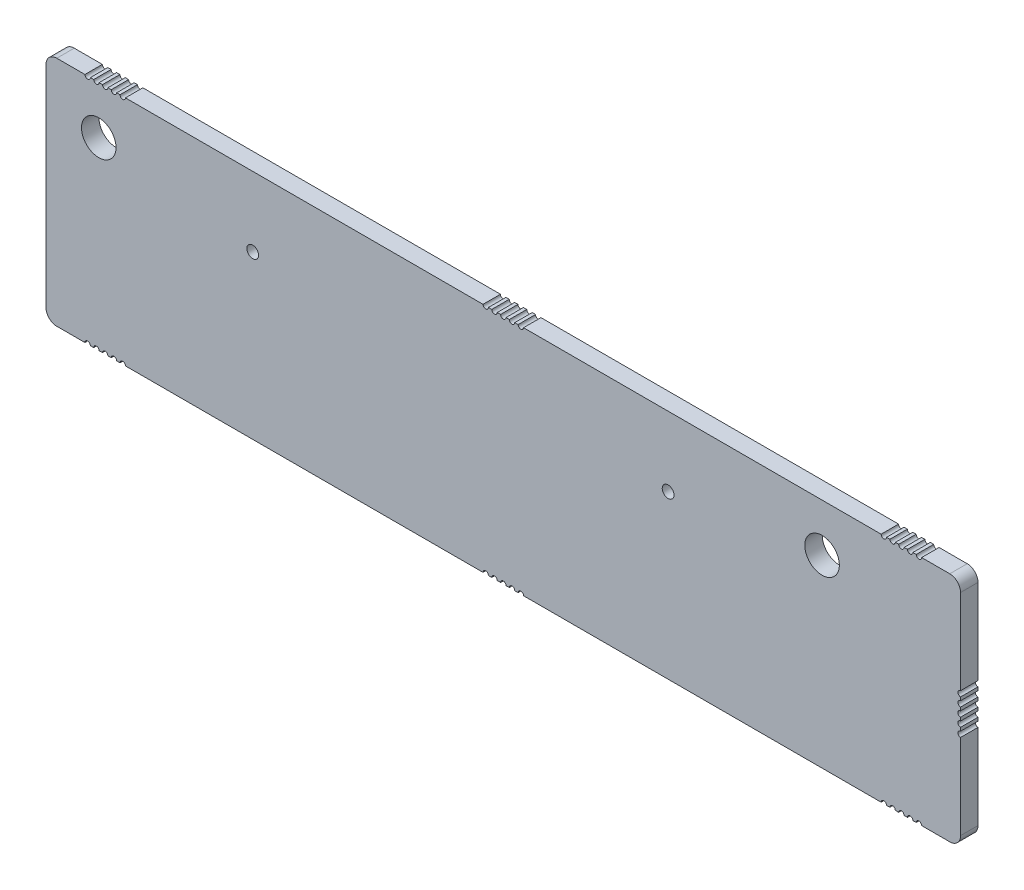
ISO-10303-21;
HEADER;
FILE_DESCRIPTION(('STEP AP214'),'2;1');
FILE_NAME('part.step','',(''),(''),'','','');
FILE_SCHEMA(('AUTOMOTIVE_DESIGN { 1 0 10303 214 1 1 1 1 }'));
ENDSEC;
DATA;
#1=APPLICATION_CONTEXT('core data for automotive mechanical design processes');
#2=APPLICATION_PROTOCOL_DEFINITION('international standard','automotive_design',2000,#1);
#3=PRODUCT_CONTEXT('',#1,'mechanical');
#4=PRODUCT('Part','Part','',(#3));
#5=PRODUCT_RELATED_PRODUCT_CATEGORY('part','',(#4));
#6=PRODUCT_DEFINITION_FORMATION('','',#4);
#7=PRODUCT_DEFINITION_CONTEXT('part definition',#1,'design');
#8=PRODUCT_DEFINITION('design','',#6,#7);
#9=PRODUCT_DEFINITION_SHAPE('','',#8);
#10=(LENGTH_UNIT() NAMED_UNIT(*) SI_UNIT(.MILLI.,.METRE.));
#11=(NAMED_UNIT(*) PLANE_ANGLE_UNIT() SI_UNIT($,.RADIAN.));
#12=(NAMED_UNIT(*) SI_UNIT($,.STERADIAN.) SOLID_ANGLE_UNIT());
#13=UNCERTAINTY_MEASURE_WITH_UNIT(LENGTH_MEASURE(1.E-05),#10,'distance_accuracy_value','');
#14=(GEOMETRIC_REPRESENTATION_CONTEXT(3) GLOBAL_UNCERTAINTY_ASSIGNED_CONTEXT((#13)) GLOBAL_UNIT_ASSIGNED_CONTEXT((#10,
#11,#12)) REPRESENTATION_CONTEXT('',''));
#15=CARTESIAN_POINT('',(0.,0.,0.));
#16=DIRECTION('',(0.,0.,1.));
#17=DIRECTION('',(1.,0.,0.));
#18=AXIS2_PLACEMENT_3D('',#15,#16,#17);
#19=CARTESIAN_POINT('',(37.46999999,4.4320000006,0.));
#20=DIRECTION('',(0.,0.,1.));
#21=DIRECTION('',(1.,0.,0.));
#22=AXIS2_PLACEMENT_3D('',#19,#20,#21);
#23=CYLINDRICAL_SURFACE('',#22,0.2499999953);
#24=CARTESIAN_POINT('',(37.46999999,4.4320000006,1.61499999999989));
#25=DIRECTION('',(0.,0.,1.));
#26=DIRECTION('',(1.,0.,0.));
#27=AXIS2_PLACEMENT_3D('',#24,#25,#26);
#28=CIRCLE('',#27,0.2499999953);
#29=CARTESIAN_POINT('',(37.7199999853,4.43200000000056,1.61499999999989));
#30=VERTEX_POINT('',#29);
#31=CARTESIAN_POINT('',(37.2199999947,4.43200000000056,1.61499999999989));
#32=VERTEX_POINT('',#31);
#33=EDGE_CURVE('E384',#30,#32,#28,.F.);
#34=ORIENTED_EDGE('',*,*,#33,.F.);
#35=DIRECTION('',(0.,0.,1.));
#36=VECTOR('',#35,1.);
#37=CARTESIAN_POINT('',(37.7199999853,4.43200000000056,0.));
#38=LINE('',#37,#36);
#39=CARTESIAN_POINT('',(37.7199999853,4.43200000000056,0.));
#40=VERTEX_POINT('',#39);
#41=EDGE_CURVE('E381',#40,#30,#38,.T.);
#42=ORIENTED_EDGE('',*,*,#41,.F.);
#43=CARTESIAN_POINT('',(37.46999999,4.4320000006,0.));
#44=DIRECTION('',(0.,0.,1.));
#45=DIRECTION('',(1.,0.,0.));
#46=AXIS2_PLACEMENT_3D('',#43,#44,#45);
#47=CIRCLE('',#46,0.2499999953);
#48=CARTESIAN_POINT('',(37.2199999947,4.43200000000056,0.));
#49=VERTEX_POINT('',#48);
#50=EDGE_CURVE('E20',#49,#40,#47,.T.);
#51=ORIENTED_EDGE('',*,*,#50,.F.);
#52=DIRECTION('',(0.,0.,1.));
#53=VECTOR('',#52,1.);
#54=CARTESIAN_POINT('',(37.2199999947,4.43200000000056,0.));
#55=LINE('',#54,#53);
#56=EDGE_CURVE('E379',#32,#49,#55,.F.);
#57=ORIENTED_EDGE('',*,*,#56,.F.);
#58=EDGE_LOOP('',(#34,#42,#51,#57));
#59=FACE_BOUND('',#58,.T.);
#60=ADVANCED_FACE('F17',(#59),#23,.F.);
#61=CARTESIAN_POINT('',(0.5930000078,4.4320000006,0.));
#62=DIRECTION('',(0.,0.,1.));
#63=DIRECTION('',(1.,0.,0.));
#64=AXIS2_PLACEMENT_3D('',#61,#62,#63);
#65=CYLINDRICAL_SURFACE('',#64,0.2499999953);
#66=CARTESIAN_POINT('',(0.5930000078,4.4320000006,1.61499999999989));
#67=DIRECTION('',(0.,0.,1.));
#68=DIRECTION('',(1.,0.,0.));
#69=AXIS2_PLACEMENT_3D('',#66,#67,#68);
#70=CIRCLE('',#69,0.2499999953);
#71=CARTESIAN_POINT('',(0.843000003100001,4.43200000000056,1.61499999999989));
#72=VERTEX_POINT('',#71);
#73=CARTESIAN_POINT('',(0.343000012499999,4.43200000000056,1.61499999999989));
#74=VERTEX_POINT('',#73);
#75=EDGE_CURVE('E754',#72,#74,#70,.F.);
#76=ORIENTED_EDGE('',*,*,#75,.F.);
#77=DIRECTION('',(0.,0.,1.));
#78=VECTOR('',#77,1.);
#79=CARTESIAN_POINT('',(0.843000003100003,4.43200000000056,0.));
#80=LINE('',#79,#78);
#81=CARTESIAN_POINT('',(0.843000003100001,4.43200000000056,0.));
#82=VERTEX_POINT('',#81);
#83=EDGE_CURVE('E414',#82,#72,#80,.T.);
#84=ORIENTED_EDGE('',*,*,#83,.F.);
#85=CARTESIAN_POINT('',(0.5930000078,4.4320000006,0.));
#86=DIRECTION('',(0.,0.,1.));
#87=DIRECTION('',(1.,0.,0.));
#88=AXIS2_PLACEMENT_3D('',#85,#86,#87);
#89=CIRCLE('',#88,0.2499999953);
#90=CARTESIAN_POINT('',(0.343000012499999,4.43200000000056,0.));
#91=VERTEX_POINT('',#90);
#92=EDGE_CURVE('E757',#91,#82,#89,.T.);
#93=ORIENTED_EDGE('',*,*,#92,.F.);
#94=DIRECTION('',(0.,0.,1.));
#95=VECTOR('',#94,1.);
#96=CARTESIAN_POINT('',(0.343000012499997,4.43200000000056,0.));
#97=LINE('',#96,#95);
#98=EDGE_CURVE('E400',#74,#91,#97,.F.);
#99=ORIENTED_EDGE('',*,*,#98,.F.);
#100=EDGE_LOOP('',(#76,#84,#93,#99));
#101=FACE_BOUND('',#100,.T.);
#102=ADVANCED_FACE('F1908',(#101),#65,.F.);
#103=CARTESIAN_POINT('',(0.5930000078,-17.0729999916,0.));
#104=DIRECTION('',(0.,0.,1.));
#105=DIRECTION('',(1.,0.,0.));
#106=AXIS2_PLACEMENT_3D('',#103,#104,#105);
#107=CYLINDRICAL_SURFACE('',#106,0.2499999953);
#108=CARTESIAN_POINT('',(0.5930000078,-17.0729999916,1.61499999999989));
#109=DIRECTION('',(0.,0.,1.));
#110=DIRECTION('',(1.,0.,0.));
#111=AXIS2_PLACEMENT_3D('',#108,#109,#110);
#112=CIRCLE('',#111,0.2499999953);
#113=CARTESIAN_POINT('',(0.3430000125,-17.0729999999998,1.61499999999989));
#114=VERTEX_POINT('',#113);
#115=CARTESIAN_POINT('',(0.8430000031,-17.0729999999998,1.61499999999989));
#116=VERTEX_POINT('',#115);
#117=EDGE_CURVE('E748',#114,#116,#112,.F.);
#118=ORIENTED_EDGE('',*,*,#117,.F.);
#119=DIRECTION('',(0.,0.,-1.));
#120=VECTOR('',#119,1.);
#121=CARTESIAN_POINT('',(0.3430000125,-17.0729999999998,0.));
#122=LINE('',#121,#120);
#123=CARTESIAN_POINT('',(0.3430000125,-17.0729999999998,0.));
#124=VERTEX_POINT('',#123);
#125=EDGE_CURVE('E472',#124,#114,#122,.F.);
#126=ORIENTED_EDGE('',*,*,#125,.F.);
#127=CARTESIAN_POINT('',(0.5930000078,-17.0729999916,0.));
#128=DIRECTION('',(0.,0.,1.));
#129=DIRECTION('',(1.,0.,0.));
#130=AXIS2_PLACEMENT_3D('',#127,#128,#129);
#131=CIRCLE('',#130,0.2499999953);
#132=CARTESIAN_POINT('',(0.8430000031,-17.0729999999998,0.));
#133=VERTEX_POINT('',#132);
#134=EDGE_CURVE('E751',#133,#124,#131,.T.);
#135=ORIENTED_EDGE('',*,*,#134,.F.);
#136=DIRECTION('',(0.,0.,-1.));
#137=VECTOR('',#136,1.);
#138=CARTESIAN_POINT('',(0.8430000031,-17.0729999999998,0.));
#139=LINE('',#138,#137);
#140=EDGE_CURVE('E467',#116,#133,#139,.T.);
#141=ORIENTED_EDGE('',*,*,#140,.F.);
#142=EDGE_LOOP('',(#118,#126,#135,#141));
#143=FACE_BOUND('',#142,.T.);
#144=ADVANCED_FACE('F1899',(#143),#107,.F.);
#145=CARTESIAN_POINT('',(37.470999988,-17.0729999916,0.));
#146=DIRECTION('',(0.,0.,1.));
#147=DIRECTION('',(1.,0.,0.));
#148=AXIS2_PLACEMENT_3D('',#145,#146,#147);
#149=CYLINDRICAL_SURFACE('',#148,0.2499999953);
#150=CARTESIAN_POINT('',(37.470999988,-17.0729999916,1.61499999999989));
#151=DIRECTION('',(0.,0.,1.));
#152=DIRECTION('',(1.,0.,0.));
#153=AXIS2_PLACEMENT_3D('',#150,#151,#152);
#154=CIRCLE('',#153,0.2499999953);
#155=CARTESIAN_POINT('',(37.2209999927,-17.0729999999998,1.61499999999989));
#156=VERTEX_POINT('',#155);
#157=CARTESIAN_POINT('',(37.7209999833,-17.0729999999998,1.61499999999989));
#158=VERTEX_POINT('',#157);
#159=EDGE_CURVE('E742',#156,#158,#154,.F.);
#160=ORIENTED_EDGE('',*,*,#159,.F.);
#161=DIRECTION('',(0.,0.,-1.));
#162=VECTOR('',#161,1.);
#163=CARTESIAN_POINT('',(37.2209999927,-17.0729999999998,0.));
#164=LINE('',#163,#162);
#165=CARTESIAN_POINT('',(37.2209999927,-17.0729999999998,0.));
#166=VERTEX_POINT('',#165);
#167=EDGE_CURVE('E463',#166,#156,#164,.F.);
#168=ORIENTED_EDGE('',*,*,#167,.F.);
#169=CARTESIAN_POINT('',(37.470999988,-17.0729999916,0.));
#170=DIRECTION('',(0.,0.,1.));
#171=DIRECTION('',(1.,0.,0.));
#172=AXIS2_PLACEMENT_3D('',#169,#170,#171);
#173=CIRCLE('',#172,0.2499999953);
#174=CARTESIAN_POINT('',(37.7209999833,-17.0729999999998,0.));
#175=VERTEX_POINT('',#174);
#176=EDGE_CURVE('E745',#175,#166,#173,.T.);
#177=ORIENTED_EDGE('',*,*,#176,.F.);
#178=DIRECTION('',(0.,0.,-1.));
#179=VECTOR('',#178,1.);
#180=CARTESIAN_POINT('',(37.7209999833,-17.0729999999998,0.));
#181=LINE('',#180,#179);
#182=EDGE_CURVE('E453',#158,#175,#181,.T.);
#183=ORIENTED_EDGE('',*,*,#182,.F.);
#184=EDGE_LOOP('',(#160,#168,#177,#183));
#185=FACE_BOUND('',#184,.T.);
#186=ADVANCED_FACE('F1890',(#185),#149,.F.);
#187=CARTESIAN_POINT('',(74.3479999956,-17.0729999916,0.));
#188=DIRECTION('',(0.,0.,1.));
#189=DIRECTION('',(1.,0.,0.));
#190=AXIS2_PLACEMENT_3D('',#187,#188,#189);
#191=CYLINDRICAL_SURFACE('',#190,0.2499999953);
#192=CARTESIAN_POINT('',(74.3479999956,-17.0729999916,1.61499999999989));
#193=DIRECTION('',(0.,0.,1.));
#194=DIRECTION('',(1.,0.,0.));
#195=AXIS2_PLACEMENT_3D('',#192,#193,#194);
#196=CIRCLE('',#195,0.2499999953);
#197=CARTESIAN_POINT('',(74.0980000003,-17.0729999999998,1.61499999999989));
#198=VERTEX_POINT('',#197);
#199=CARTESIAN_POINT('',(74.5979999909,-17.0729999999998,1.61499999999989));
#200=VERTEX_POINT('',#199);
#201=EDGE_CURVE('E736',#198,#200,#196,.F.);
#202=ORIENTED_EDGE('',*,*,#201,.F.);
#203=DIRECTION('',(0.,0.,-1.));
#204=VECTOR('',#203,1.);
#205=CARTESIAN_POINT('',(74.0980000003,-17.0729999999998,0.));
#206=LINE('',#205,#204);
#207=CARTESIAN_POINT('',(74.0980000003,-17.0729999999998,0.));
#208=VERTEX_POINT('',#207);
#209=EDGE_CURVE('E458',#208,#198,#206,.F.);
#210=ORIENTED_EDGE('',*,*,#209,.F.);
#211=CARTESIAN_POINT('',(74.3479999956,-17.0729999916,0.));
#212=DIRECTION('',(0.,0.,1.));
#213=DIRECTION('',(1.,0.,0.));
#214=AXIS2_PLACEMENT_3D('',#211,#212,#213);
#215=CIRCLE('',#214,0.2499999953);
#216=CARTESIAN_POINT('',(74.5979999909,-17.0729999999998,0.));
#217=VERTEX_POINT('',#216);
#218=EDGE_CURVE('E739',#217,#208,#215,.T.);
#219=ORIENTED_EDGE('',*,*,#218,.F.);
#220=DIRECTION('',(0.,0.,-1.));
#221=VECTOR('',#220,1.);
#222=CARTESIAN_POINT('',(74.5979999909,-17.0729999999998,0.));
#223=LINE('',#222,#221);
#224=EDGE_CURVE('E448',#200,#217,#223,.T.);
#225=ORIENTED_EDGE('',*,*,#224,.F.);
#226=EDGE_LOOP('',(#202,#210,#219,#225));
#227=FACE_BOUND('',#226,.T.);
#228=ADVANCED_FACE('F1881',(#227),#191,.F.);
#229=CARTESIAN_POINT('',(79.8300000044,-6.3200000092,0.));
#230=DIRECTION('',(0.,0.,1.));
#231=DIRECTION('',(1.,0.,0.));
#232=AXIS2_PLACEMENT_3D('',#229,#230,#231);
#233=CYLINDRICAL_SURFACE('',#232,0.2499999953);
#234=CARTESIAN_POINT('',(79.8300000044,-6.3200000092,1.61499999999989));
#235=DIRECTION('',(0.,0.,1.));
#236=DIRECTION('',(1.,0.,0.));
#237=AXIS2_PLACEMENT_3D('',#234,#235,#236);
#238=CIRCLE('',#237,0.2499999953);
#239=CARTESIAN_POINT('',(79.8300000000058,-6.5700000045,1.61499999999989));
#240=VERTEX_POINT('',#239);
#241=CARTESIAN_POINT('',(79.8300000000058,-6.0700000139,1.61499999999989));
#242=VERTEX_POINT('',#241);
#243=EDGE_CURVE('E730',#240,#242,#238,.F.);
#244=ORIENTED_EDGE('',*,*,#243,.F.);
#245=DIRECTION('',(0.,0.,-1.));
#246=VECTOR('',#245,1.);
#247=CARTESIAN_POINT('',(79.8300000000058,-6.5700000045,0.));
#248=LINE('',#247,#246);
#249=CARTESIAN_POINT('',(79.8300000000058,-6.5700000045,0.));
#250=VERTEX_POINT('',#249);
#251=EDGE_CURVE('E444',#250,#240,#248,.F.);
#252=ORIENTED_EDGE('',*,*,#251,.F.);
#253=CARTESIAN_POINT('',(79.8300000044,-6.3200000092,0.));
#254=DIRECTION('',(0.,0.,1.));
#255=DIRECTION('',(1.,0.,0.));
#256=AXIS2_PLACEMENT_3D('',#253,#254,#255);
#257=CIRCLE('',#256,0.2499999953);
#258=CARTESIAN_POINT('',(79.8300000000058,-6.0700000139,0.));
#259=VERTEX_POINT('',#258);
#260=EDGE_CURVE('E733',#259,#250,#257,.T.);
#261=ORIENTED_EDGE('',*,*,#260,.F.);
#262=DIRECTION('',(0.,0.,-1.));
#263=VECTOR('',#262,1.);
#264=CARTESIAN_POINT('',(79.8300000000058,-6.0700000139,0.));
#265=LINE('',#264,#263);
#266=EDGE_CURVE('E439',#242,#259,#265,.T.);
#267=ORIENTED_EDGE('',*,*,#266,.F.);
#268=EDGE_LOOP('',(#244,#252,#261,#267));
#269=FACE_BOUND('',#268,.T.);
#270=ADVANCED_FACE('F1873',(#269),#233,.F.);
#271=CARTESIAN_POINT('',(74.3479999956,4.4320000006,0.));
#272=DIRECTION('',(0.,0.,1.));
#273=DIRECTION('',(1.,0.,0.));
#274=AXIS2_PLACEMENT_3D('',#271,#272,#273);
#275=CYLINDRICAL_SURFACE('',#274,0.2499999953);
#276=CARTESIAN_POINT('',(74.3479999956,4.4320000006,1.61499999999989));
#277=DIRECTION('',(0.,0.,1.));
#278=DIRECTION('',(1.,0.,0.));
#279=AXIS2_PLACEMENT_3D('',#276,#277,#278);
#280=CIRCLE('',#279,0.2499999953);
#281=CARTESIAN_POINT('',(74.5979999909,4.43200000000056,1.61499999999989));
#282=VERTEX_POINT('',#281);
#283=CARTESIAN_POINT('',(74.0980000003,4.43200000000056,1.61499999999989));
#284=VERTEX_POINT('',#283);
#285=EDGE_CURVE('E431',#282,#284,#280,.F.);
#286=ORIENTED_EDGE('',*,*,#285,.F.);
#287=DIRECTION('',(0.,0.,1.));
#288=VECTOR('',#287,1.);
#289=CARTESIAN_POINT('',(74.5979999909,4.43200000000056,0.));
#290=LINE('',#289,#288);
#291=CARTESIAN_POINT('',(74.5979999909,4.43200000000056,0.));
#292=VERTEX_POINT('',#291);
#293=EDGE_CURVE('E434',#292,#282,#290,.T.);
#294=ORIENTED_EDGE('',*,*,#293,.F.);
#295=CARTESIAN_POINT('',(74.3479999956,4.4320000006,0.));
#296=DIRECTION('',(0.,0.,1.));
#297=DIRECTION('',(1.,0.,0.));
#298=AXIS2_PLACEMENT_3D('',#295,#296,#297);
#299=CIRCLE('',#298,0.2499999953);
#300=CARTESIAN_POINT('',(74.0980000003,4.43200000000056,0.));
#301=VERTEX_POINT('',#300);
#302=EDGE_CURVE('E728',#301,#292,#299,.T.);
#303=ORIENTED_EDGE('',*,*,#302,.F.);
#304=DIRECTION('',(0.,0.,1.));
#305=VECTOR('',#304,1.);
#306=CARTESIAN_POINT('',(74.0980000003,4.43200000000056,0.));
#307=LINE('',#306,#305);
#308=EDGE_CURVE('E422',#284,#301,#307,.F.);
#309=ORIENTED_EDGE('',*,*,#308,.F.);
#310=EDGE_LOOP('',(#286,#294,#303,#309));
#311=FACE_BOUND('',#310,.T.);
#312=ADVANCED_FACE('F1154',(#311),#275,.F.);
#313=CARTESIAN_POINT('',(78.8300000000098,4.43200000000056,0.));
#314=DIRECTION('',(0.,1.,0.));
#315=DIRECTION('',(0.,0.,1.));
#316=AXIS2_PLACEMENT_3D('',#313,#314,#315);
#317=PLANE('',#316);
#318=DIRECTION('',(1.,0.,0.));
#319=VECTOR('',#318,1.);
#320=CARTESIAN_POINT('',(78.8300000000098,4.43200000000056,0.));
#321=LINE('',#320,#319);
#322=CARTESIAN_POINT('',(38.0329999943,4.43200000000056,0.));
#323=VERTEX_POINT('',#322);
#324=EDGE_CURVE('E430',#323,#40,#321,.F.);
#325=ORIENTED_EDGE('',*,*,#324,.T.);
#326=ORIENTED_EDGE('',*,*,#41,.T.);
#327=DIRECTION('',(1.,0.,0.));
#328=VECTOR('',#327,1.);
#329=CARTESIAN_POINT('',(78.8300000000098,4.43200000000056,1.61499999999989));
#330=LINE('',#329,#328);
#331=CARTESIAN_POINT('',(38.0329999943,4.43200000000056,1.61499999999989));
#332=VERTEX_POINT('',#331);
#333=EDGE_CURVE('E428',#30,#332,#330,.T.);
#334=ORIENTED_EDGE('',*,*,#333,.T.);
#335=DIRECTION('',(0.,0.,1.));
#336=VECTOR('',#335,1.);
#337=CARTESIAN_POINT('',(38.0329999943,4.43200000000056,0.));
#338=LINE('',#337,#336);
#339=EDGE_CURVE('E424',#332,#323,#338,.F.);
#340=ORIENTED_EDGE('',*,*,#339,.T.);
#341=EDGE_LOOP('',(#325,#326,#334,#340));
#342=FACE_BOUND('',#341,.T.);
#343=ADVANCED_FACE('F764',(#342),#317,.T.);
#344=CARTESIAN_POINT('',(78.8300000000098,4.43200000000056,0.));
#345=DIRECTION('',(0.,1.,0.));
#346=DIRECTION('',(0.,0.,1.));
#347=AXIS2_PLACEMENT_3D('',#344,#345,#346);
#348=PLANE('',#347);
#349=DIRECTION('',(1.,0.,0.));
#350=VECTOR('',#349,1.);
#351=CARTESIAN_POINT('',(78.8300000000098,4.43200000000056,0.));
#352=LINE('',#351,#350);
#353=CARTESIAN_POINT('',(73.7849999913,4.43200000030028,0.));
#354=VERTEX_POINT('',#353);
#355=EDGE_CURVE('E412',#301,#354,#352,.F.);
#356=ORIENTED_EDGE('',*,*,#355,.T.);
#357=DIRECTION('',(0.,0.,1.));
#358=VECTOR('',#357,1.);
#359=CARTESIAN_POINT('',(73.7849999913,4.4320000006,0.));
#360=LINE('',#359,#358);
#361=CARTESIAN_POINT('',(73.7849999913,4.43200000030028,1.61499999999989));
#362=VERTEX_POINT('',#361);
#363=EDGE_CURVE('E415',#354,#362,#360,.T.);
#364=ORIENTED_EDGE('',*,*,#363,.T.);
#365=DIRECTION('',(1.,0.,0.));
#366=VECTOR('',#365,1.);
#367=CARTESIAN_POINT('',(78.8300000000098,4.43200000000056,1.61499999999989));
#368=LINE('',#367,#366);
#369=EDGE_CURVE('E420',#362,#284,#368,.T.);
#370=ORIENTED_EDGE('',*,*,#369,.T.);
#371=ORIENTED_EDGE('',*,*,#308,.T.);
#372=EDGE_LOOP('',(#356,#364,#370,#371));
#373=FACE_BOUND('',#372,.T.);
#374=ADVANCED_FACE('F1151',(#373),#348,.T.);
#375=CARTESIAN_POINT('',(78.8300000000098,4.43200000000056,0.));
#376=DIRECTION('',(0.,1.,0.));
#377=DIRECTION('',(0.,0.,1.));
#378=AXIS2_PLACEMENT_3D('',#375,#376,#377);
#379=PLANE('',#378);
#380=DIRECTION('',(1.,0.,0.));
#381=VECTOR('',#380,1.);
#382=CARTESIAN_POINT('',(78.8300000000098,4.43200000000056,0.));
#383=LINE('',#382,#381);
#384=CARTESIAN_POINT('',(1.1560000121,4.43200000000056,0.));
#385=VERTEX_POINT('',#384);
#386=EDGE_CURVE('E411',#385,#82,#383,.F.);
#387=ORIENTED_EDGE('',*,*,#386,.T.);
#388=ORIENTED_EDGE('',*,*,#83,.T.);
#389=DIRECTION('',(1.,0.,0.));
#390=VECTOR('',#389,1.);
#391=CARTESIAN_POINT('',(78.8300000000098,4.43200000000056,1.61499999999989));
#392=LINE('',#391,#390);
#393=CARTESIAN_POINT('',(1.1560000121,4.43200000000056,1.61499999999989));
#394=VERTEX_POINT('',#393);
#395=EDGE_CURVE('E409',#72,#394,#392,.T.);
#396=ORIENTED_EDGE('',*,*,#395,.T.);
#397=DIRECTION('',(0.,0.,1.));
#398=VECTOR('',#397,1.);
#399=CARTESIAN_POINT('',(1.1560000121,4.43200000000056,0.));
#400=LINE('',#399,#398);
#401=EDGE_CURVE('E405',#394,#385,#400,.F.);
#402=ORIENTED_EDGE('',*,*,#401,.T.);
#403=EDGE_LOOP('',(#387,#388,#396,#402));
#404=FACE_BOUND('',#403,.T.);
#405=ADVANCED_FACE('F1843',(#404),#379,.T.);
#406=CARTESIAN_POINT('',(78.8300000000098,4.43200000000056,0.));
#407=DIRECTION('',(0.,1.,0.));
#408=DIRECTION('',(0.,0.,1.));
#409=AXIS2_PLACEMENT_3D('',#406,#407,#408);
#410=PLANE('',#409);
#411=DIRECTION('',(1.,0.,0.));
#412=VECTOR('',#411,1.);
#413=CARTESIAN_POINT('',(78.8300000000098,4.43200000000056,0.));
#414=LINE('',#413,#412);
#415=CARTESIAN_POINT('',(36.9069999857,4.43200000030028,0.));
#416=VERTEX_POINT('',#415);
#417=EDGE_CURVE('E388',#49,#416,#414,.F.);
#418=ORIENTED_EDGE('',*,*,#417,.T.);
#419=DIRECTION('',(0.,0.,1.));
#420=VECTOR('',#419,1.);
#421=CARTESIAN_POINT('',(36.9069999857,4.4320000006,0.));
#422=LINE('',#421,#420);
#423=CARTESIAN_POINT('',(36.9069999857,4.43200000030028,1.61499999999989));
#424=VERTEX_POINT('',#423);
#425=EDGE_CURVE('E711',#416,#424,#422,.T.);
#426=ORIENTED_EDGE('',*,*,#425,.T.);
#427=DIRECTION('',(1.,0.,0.));
#428=VECTOR('',#427,1.);
#429=CARTESIAN_POINT('',(78.8300000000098,4.43200000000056,1.61499999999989));
#430=LINE('',#429,#428);
#431=EDGE_CURVE('E390',#424,#32,#430,.T.);
#432=ORIENTED_EDGE('',*,*,#431,.T.);
#433=ORIENTED_EDGE('',*,*,#56,.T.);
#434=EDGE_LOOP('',(#418,#426,#432,#433));
#435=FACE_BOUND('',#434,.T.);
#436=ADVANCED_FACE('F386',(#435),#410,.T.);
#437=CARTESIAN_POINT('',(78.8300000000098,4.43200000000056,0.));
#438=DIRECTION('',(0.,1.,0.));
#439=DIRECTION('',(0.,0.,1.));
#440=AXIS2_PLACEMENT_3D('',#437,#438,#439);
#441=PLANE('',#440);
#442=DIRECTION('',(1.,0.,0.));
#443=VECTOR('',#442,1.);
#444=CARTESIAN_POINT('',(78.8300000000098,4.43200000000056,0.));
#445=LINE('',#444,#443);
#446=CARTESIAN_POINT('',(0.0300000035,4.43200000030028,0.));
#447=VERTEX_POINT('',#446);
#448=EDGE_CURVE('E478',#91,#447,#445,.F.);
#449=ORIENTED_EDGE('',*,*,#448,.T.);
#450=DIRECTION('',(0.,0.,1.));
#451=VECTOR('',#450,1.);
#452=CARTESIAN_POINT('',(0.0300000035,4.4320000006,0.));
#453=LINE('',#452,#451);
#454=CARTESIAN_POINT('',(0.0300000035,4.43200000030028,1.61499999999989));
#455=VERTEX_POINT('',#454);
#456=EDGE_CURVE('E704',#447,#455,#453,.T.);
#457=ORIENTED_EDGE('',*,*,#456,.T.);
#458=DIRECTION('',(1.,0.,0.));
#459=VECTOR('',#458,1.);
#460=CARTESIAN_POINT('',(78.8300000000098,4.43200000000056,1.61499999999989));
#461=LINE('',#460,#459);
#462=EDGE_CURVE('E398',#455,#74,#461,.T.);
#463=ORIENTED_EDGE('',*,*,#462,.T.);
#464=ORIENTED_EDGE('',*,*,#98,.T.);
#465=EDGE_LOOP('',(#449,#457,#463,#464));
#466=FACE_BOUND('',#465,.T.);
#467=ADVANCED_FACE('F1826',(#466),#441,.T.);
#468=CARTESIAN_POINT('',(-3.88799999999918,-17.0729999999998,0.));
#469=DIRECTION('',(0.,-1.,0.));
#470=DIRECTION('',(0.,0.,-1.));
#471=AXIS2_PLACEMENT_3D('',#468,#469,#470);
#472=PLANE('',#471);
#473=DIRECTION('',(1.,0.,0.));
#474=VECTOR('',#473,1.);
#475=CARTESIAN_POINT('',(-3.88799999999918,-17.0729999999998,1.61499999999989));
#476=LINE('',#475,#474);
#477=CARTESIAN_POINT('',(0.0300000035,-17.0729999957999,1.61499999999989));
#478=VERTEX_POINT('',#477);
#479=EDGE_CURVE('E475',#114,#478,#476,.F.);
#480=ORIENTED_EDGE('',*,*,#479,.T.);
#481=DIRECTION('',(0.,0.,1.));
#482=VECTOR('',#481,1.);
#483=CARTESIAN_POINT('',(0.0300000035,-17.0729999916,0.));
#484=LINE('',#483,#482);
#485=CARTESIAN_POINT('',(0.0300000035,-17.0729999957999,0.));
#486=VERTEX_POINT('',#485);
#487=EDGE_CURVE('E694',#478,#486,#484,.F.);
#488=ORIENTED_EDGE('',*,*,#487,.T.);
#489=DIRECTION('',(1.,0.,0.));
#490=VECTOR('',#489,1.);
#491=CARTESIAN_POINT('',(-3.88799999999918,-17.0729999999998,0.));
#492=LINE('',#491,#490);
#493=EDGE_CURVE('E476',#486,#124,#492,.T.);
#494=ORIENTED_EDGE('',*,*,#493,.T.);
#495=ORIENTED_EDGE('',*,*,#125,.T.);
#496=EDGE_LOOP('',(#480,#488,#494,#495));
#497=FACE_BOUND('',#496,.T.);
#498=ADVANCED_FACE('F1817',(#497),#472,.T.);
#499=CARTESIAN_POINT('',(-3.88799999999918,-17.0729999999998,0.));
#500=DIRECTION('',(0.,-1.,0.));
#501=DIRECTION('',(0.,0.,-1.));
#502=AXIS2_PLACEMENT_3D('',#499,#500,#501);
#503=PLANE('',#502);
#504=DIRECTION('',(1.,0.,0.));
#505=VECTOR('',#504,1.);
#506=CARTESIAN_POINT('',(-3.88799999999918,-17.0729999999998,1.61499999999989));
#507=LINE('',#506,#505);
#508=CARTESIAN_POINT('',(1.1560000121,-17.0729999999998,1.61499999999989));
#509=VERTEX_POINT('',#508);
#510=EDGE_CURVE('E471',#509,#116,#507,.F.);
#511=ORIENTED_EDGE('',*,*,#510,.T.);
#512=ORIENTED_EDGE('',*,*,#140,.T.);
#513=DIRECTION('',(1.,0.,0.));
#514=VECTOR('',#513,1.);
#515=CARTESIAN_POINT('',(-3.88799999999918,-17.0729999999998,0.));
#516=LINE('',#515,#514);
#517=CARTESIAN_POINT('',(1.1560000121,-17.0729999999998,0.));
#518=VERTEX_POINT('',#517);
#519=EDGE_CURVE('E820',#133,#518,#516,.T.);
#520=ORIENTED_EDGE('',*,*,#519,.T.);
#521=DIRECTION('',(0.,0.,1.));
#522=VECTOR('',#521,1.);
#523=CARTESIAN_POINT('',(1.1560000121,-17.0729999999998,0.));
#524=LINE('',#523,#522);
#525=EDGE_CURVE('E690',#518,#509,#524,.T.);
#526=ORIENTED_EDGE('',*,*,#525,.T.);
#527=EDGE_LOOP('',(#511,#512,#520,#526));
#528=FACE_BOUND('',#527,.T.);
#529=ADVANCED_FACE('F1808',(#528),#503,.T.);
#530=CARTESIAN_POINT('',(-3.88799999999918,-17.0729999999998,0.));
#531=DIRECTION('',(0.,-1.,0.));
#532=DIRECTION('',(0.,0.,-1.));
#533=AXIS2_PLACEMENT_3D('',#530,#531,#532);
#534=PLANE('',#533);
#535=DIRECTION('',(1.,0.,0.));
#536=VECTOR('',#535,1.);
#537=CARTESIAN_POINT('',(-3.88799999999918,-17.0729999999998,0.));
#538=LINE('',#537,#536);
#539=CARTESIAN_POINT('',(36.9079999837,-17.0729999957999,0.));
#540=VERTEX_POINT('',#539);
#541=EDGE_CURVE('E466',#540,#166,#538,.T.);
#542=ORIENTED_EDGE('',*,*,#541,.T.);
#543=ORIENTED_EDGE('',*,*,#167,.T.);
#544=DIRECTION('',(1.,0.,0.));
#545=VECTOR('',#544,1.);
#546=CARTESIAN_POINT('',(-3.88799999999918,-17.0729999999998,1.61499999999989));
#547=LINE('',#546,#545);
#548=CARTESIAN_POINT('',(36.9079999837,-17.0729999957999,1.61499999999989));
#549=VERTEX_POINT('',#548);
#550=EDGE_CURVE('E470',#156,#549,#547,.F.);
#551=ORIENTED_EDGE('',*,*,#550,.T.);
#552=DIRECTION('',(0.,0.,1.));
#553=VECTOR('',#552,1.);
#554=CARTESIAN_POINT('',(36.9079999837,-17.0729999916,0.));
#555=LINE('',#554,#553);
#556=EDGE_CURVE('E680',#549,#540,#555,.F.);
#557=ORIENTED_EDGE('',*,*,#556,.T.);
#558=EDGE_LOOP('',(#542,#543,#551,#557));
#559=FACE_BOUND('',#558,.T.);
#560=ADVANCED_FACE('F1799',(#559),#534,.T.);
#561=CARTESIAN_POINT('',(-3.88799999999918,-17.0729999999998,0.));
#562=DIRECTION('',(0.,-1.,0.));
#563=DIRECTION('',(0.,0.,-1.));
#564=AXIS2_PLACEMENT_3D('',#561,#562,#563);
#565=PLANE('',#564);
#566=DIRECTION('',(1.,0.,0.));
#567=VECTOR('',#566,1.);
#568=CARTESIAN_POINT('',(-3.88799999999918,-17.0729999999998,1.61499999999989));
#569=LINE('',#568,#567);
#570=CARTESIAN_POINT('',(73.7849999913,-17.0729999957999,1.61499999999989));
#571=VERTEX_POINT('',#570);
#572=EDGE_CURVE('E461',#198,#571,#569,.F.);
#573=ORIENTED_EDGE('',*,*,#572,.T.);
#574=DIRECTION('',(0.,0.,1.));
#575=VECTOR('',#574,1.);
#576=CARTESIAN_POINT('',(73.7849999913,-17.0729999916,0.));
#577=LINE('',#576,#575);
#578=CARTESIAN_POINT('',(73.7849999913,-17.0729999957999,0.));
#579=VERTEX_POINT('',#578);
#580=EDGE_CURVE('E673',#571,#579,#577,.F.);
#581=ORIENTED_EDGE('',*,*,#580,.T.);
#582=DIRECTION('',(1.,0.,0.));
#583=VECTOR('',#582,1.);
#584=CARTESIAN_POINT('',(-3.88799999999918,-17.0729999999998,0.));
#585=LINE('',#584,#583);
#586=EDGE_CURVE('E462',#579,#208,#585,.T.);
#587=ORIENTED_EDGE('',*,*,#586,.T.);
#588=ORIENTED_EDGE('',*,*,#209,.T.);
#589=EDGE_LOOP('',(#573,#581,#587,#588));
#590=FACE_BOUND('',#589,.T.);
#591=ADVANCED_FACE('F1790',(#590),#565,.T.);
#592=CARTESIAN_POINT('',(-3.88799999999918,-17.0729999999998,0.));
#593=DIRECTION('',(0.,-1.,0.));
#594=DIRECTION('',(0.,0.,-1.));
#595=AXIS2_PLACEMENT_3D('',#592,#593,#594);
#596=PLANE('',#595);
#597=DIRECTION('',(1.,0.,0.));
#598=VECTOR('',#597,1.);
#599=CARTESIAN_POINT('',(-3.88799999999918,-17.0729999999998,0.));
#600=LINE('',#599,#598);
#601=CARTESIAN_POINT('',(38.0339999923,-17.0729999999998,0.));
#602=VERTEX_POINT('',#601);
#603=EDGE_CURVE('E456',#175,#602,#600,.T.);
#604=ORIENTED_EDGE('',*,*,#603,.T.);
#605=DIRECTION('',(0.,0.,1.));
#606=VECTOR('',#605,1.);
#607=CARTESIAN_POINT('',(38.0339999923,-17.0729999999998,0.));
#608=LINE('',#607,#606);
#609=CARTESIAN_POINT('',(38.0339999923,-17.0729999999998,1.61499999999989));
#610=VERTEX_POINT('',#609);
#611=EDGE_CURVE('E669',#602,#610,#608,.T.);
#612=ORIENTED_EDGE('',*,*,#611,.T.);
#613=DIRECTION('',(1.,0.,0.));
#614=VECTOR('',#613,1.);
#615=CARTESIAN_POINT('',(-3.88799999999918,-17.0729999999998,1.61499999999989));
#616=LINE('',#615,#614);
#617=EDGE_CURVE('E457',#610,#158,#616,.F.);
#618=ORIENTED_EDGE('',*,*,#617,.T.);
#619=ORIENTED_EDGE('',*,*,#182,.T.);
#620=EDGE_LOOP('',(#604,#612,#618,#619));
#621=FACE_BOUND('',#620,.T.);
#622=ADVANCED_FACE('F1781',(#621),#596,.T.);
#623=CARTESIAN_POINT('',(-3.88799999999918,-17.0729999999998,0.));
#624=DIRECTION('',(0.,-1.,0.));
#625=DIRECTION('',(0.,0.,-1.));
#626=AXIS2_PLACEMENT_3D('',#623,#624,#625);
#627=PLANE('',#626);
#628=DIRECTION('',(1.,0.,0.));
#629=VECTOR('',#628,1.);
#630=CARTESIAN_POINT('',(-3.88799999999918,-17.0729999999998,1.61499999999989));
#631=LINE('',#630,#629);
#632=CARTESIAN_POINT('',(74.9109999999,-17.0729999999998,1.61499999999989));
#633=VERTEX_POINT('',#632);
#634=EDGE_CURVE('E452',#633,#200,#631,.F.);
#635=ORIENTED_EDGE('',*,*,#634,.T.);
#636=ORIENTED_EDGE('',*,*,#224,.T.);
#637=DIRECTION('',(1.,0.,0.));
#638=VECTOR('',#637,1.);
#639=CARTESIAN_POINT('',(-3.88799999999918,-17.0729999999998,0.));
#640=LINE('',#639,#638);
#641=CARTESIAN_POINT('',(74.9109999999,-17.0729999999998,0.));
#642=VERTEX_POINT('',#641);
#643=EDGE_CURVE('E803',#217,#642,#640,.T.);
#644=ORIENTED_EDGE('',*,*,#643,.T.);
#645=DIRECTION('',(0.,0.,1.));
#646=VECTOR('',#645,1.);
#647=CARTESIAN_POINT('',(74.9109999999,-17.0729999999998,0.));
#648=LINE('',#647,#646);
#649=EDGE_CURVE('E662',#642,#633,#648,.T.);
#650=ORIENTED_EDGE('',*,*,#649,.T.);
#651=EDGE_LOOP('',(#635,#636,#644,#650));
#652=FACE_BOUND('',#651,.T.);
#653=ADVANCED_FACE('F1772',(#652),#627,.T.);
#654=CARTESIAN_POINT('',(79.8300000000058,-16.0730000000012,0.));
#655=DIRECTION('',(1.,0.,0.));
#656=DIRECTION('',(0.,0.,-1.));
#657=AXIS2_PLACEMENT_3D('',#654,#655,#656);
#658=PLANE('',#657);
#659=DIRECTION('',(0.,1.,0.));
#660=VECTOR('',#659,1.);
#661=CARTESIAN_POINT('',(79.8300000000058,-16.0730000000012,0.));
#662=LINE('',#661,#660);
#663=CARTESIAN_POINT('',(79.8300000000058,-6.8830000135,0.));
#664=VERTEX_POINT('',#663);
#665=EDGE_CURVE('E447',#664,#250,#662,.T.);
#666=ORIENTED_EDGE('',*,*,#665,.T.);
#667=ORIENTED_EDGE('',*,*,#251,.T.);
#668=DIRECTION('',(0.,1.,0.));
#669=VECTOR('',#668,1.);
#670=CARTESIAN_POINT('',(79.8300000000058,-16.0730000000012,1.61499999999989));
#671=LINE('',#670,#669);
#672=CARTESIAN_POINT('',(79.8300000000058,-6.8830000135,1.61499999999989));
#673=VERTEX_POINT('',#672);
#674=EDGE_CURVE('E451',#240,#673,#671,.F.);
#675=ORIENTED_EDGE('',*,*,#674,.T.);
#676=DIRECTION('',(0.,0.,1.));
#677=VECTOR('',#676,1.);
#678=CARTESIAN_POINT('',(79.8300000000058,-6.8830000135,0.));
#679=LINE('',#678,#677);
#680=EDGE_CURVE('E652',#673,#664,#679,.F.);
#681=ORIENTED_EDGE('',*,*,#680,.T.);
#682=EDGE_LOOP('',(#666,#667,#675,#681));
#683=FACE_BOUND('',#682,.T.);
#684=ADVANCED_FACE('F1763',(#683),#658,.T.);
#685=CARTESIAN_POINT('',(79.8300000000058,-16.0730000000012,0.));
#686=DIRECTION('',(1.,0.,0.));
#687=DIRECTION('',(0.,0.,-1.));
#688=AXIS2_PLACEMENT_3D('',#685,#686,#687);
#689=PLANE('',#688);
#690=DIRECTION('',(0.,1.,0.));
#691=VECTOR('',#690,1.);
#692=CARTESIAN_POINT('',(79.8300000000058,-16.0730000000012,0.));
#693=LINE('',#692,#691);
#694=CARTESIAN_POINT('',(79.8300000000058,-5.7570000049,0.));
#695=VERTEX_POINT('',#694);
#696=EDGE_CURVE('E442',#259,#695,#693,.T.);
#697=ORIENTED_EDGE('',*,*,#696,.T.);
#698=DIRECTION('',(0.,0.,1.));
#699=VECTOR('',#698,1.);
#700=CARTESIAN_POINT('',(79.8300000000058,-5.7570000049,0.));
#701=LINE('',#700,#699);
#702=CARTESIAN_POINT('',(79.8300000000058,-5.7570000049,1.61499999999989));
#703=VERTEX_POINT('',#702);
#704=EDGE_CURVE('E648',#695,#703,#701,.T.);
#705=ORIENTED_EDGE('',*,*,#704,.T.);
#706=DIRECTION('',(0.,1.,0.));
#707=VECTOR('',#706,1.);
#708=CARTESIAN_POINT('',(79.8300000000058,-16.0730000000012,1.61499999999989));
#709=LINE('',#708,#707);
#710=EDGE_CURVE('E443',#703,#242,#709,.F.);
#711=ORIENTED_EDGE('',*,*,#710,.T.);
#712=ORIENTED_EDGE('',*,*,#266,.T.);
#713=EDGE_LOOP('',(#697,#705,#711,#712));
#714=FACE_BOUND('',#713,.T.);
#715=ADVANCED_FACE('F1755',(#714),#689,.T.);
#716=CARTESIAN_POINT('',(78.8300000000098,4.43200000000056,0.));
#717=DIRECTION('',(0.,1.,0.));
#718=DIRECTION('',(0.,0.,1.));
#719=AXIS2_PLACEMENT_3D('',#716,#717,#718);
#720=PLANE('',#719);
#721=DIRECTION('',(1.,0.,0.));
#722=VECTOR('',#721,1.);
#723=CARTESIAN_POINT('',(78.8300000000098,4.43200000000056,0.));
#724=LINE('',#723,#722);
#725=CARTESIAN_POINT('',(74.9109999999,4.43200000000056,0.));
#726=VERTEX_POINT('',#725);
#727=EDGE_CURVE('E438',#726,#292,#724,.F.);
#728=ORIENTED_EDGE('',*,*,#727,.T.);
#729=ORIENTED_EDGE('',*,*,#293,.T.);
#730=DIRECTION('',(1.,0.,0.));
#731=VECTOR('',#730,1.);
#732=CARTESIAN_POINT('',(78.8300000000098,4.43200000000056,1.61499999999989));
#733=LINE('',#732,#731);
#734=CARTESIAN_POINT('',(74.9109999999,4.43200000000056,1.61499999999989));
#735=VERTEX_POINT('',#734);
#736=EDGE_CURVE('E789',#282,#735,#733,.T.);
#737=ORIENTED_EDGE('',*,*,#736,.T.);
#738=DIRECTION('',(0.,0.,1.));
#739=VECTOR('',#738,1.);
#740=CARTESIAN_POINT('',(74.9109999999,4.43200000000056,0.));
#741=LINE('',#740,#739);
#742=EDGE_CURVE('E641',#735,#726,#741,.F.);
#743=ORIENTED_EDGE('',*,*,#742,.T.);
#744=EDGE_LOOP('',(#728,#729,#737,#743));
#745=FACE_BOUND('',#744,.T.);
#746=ADVANCED_FACE('F1158',(#745),#720,.T.);
#747=CARTESIAN_POINT('',(38.2829999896,4.4320000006,0.));
#748=DIRECTION('',(0.,0.,1.));
#749=DIRECTION('',(1.,0.,0.));
#750=AXIS2_PLACEMENT_3D('',#747,#748,#749);
#751=CYLINDRICAL_SURFACE('',#750,0.2499999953);
#752=CARTESIAN_POINT('',(38.2829999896,4.4320000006,1.61499999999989));
#753=DIRECTION('',(0.,0.,1.));
#754=DIRECTION('',(1.,0.,0.));
#755=AXIS2_PLACEMENT_3D('',#752,#753,#754);
#756=CIRCLE('',#755,0.2499999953);
#757=CARTESIAN_POINT('',(38.5329999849,4.43200000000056,1.61499999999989));
#758=VERTEX_POINT('',#757);
#759=EDGE_CURVE('E427',#758,#332,#756,.F.);
#760=ORIENTED_EDGE('',*,*,#759,.F.);
#761=DIRECTION('',(0.,0.,1.));
#762=VECTOR('',#761,1.);
#763=CARTESIAN_POINT('',(38.5329999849,4.43200000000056,0.));
#764=LINE('',#763,#762);
#765=CARTESIAN_POINT('',(38.5329999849,4.43200000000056,0.));
#766=VERTEX_POINT('',#765);
#767=EDGE_CURVE('E772',#766,#758,#764,.T.);
#768=ORIENTED_EDGE('',*,*,#767,.F.);
#769=CARTESIAN_POINT('',(38.2829999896,4.4320000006,0.));
#770=DIRECTION('',(0.,0.,1.));
#771=DIRECTION('',(1.,0.,0.));
#772=AXIS2_PLACEMENT_3D('',#769,#770,#771);
#773=CIRCLE('',#772,0.2499999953);
#774=EDGE_CURVE('E437',#323,#766,#773,.T.);
#775=ORIENTED_EDGE('',*,*,#774,.F.);
#776=ORIENTED_EDGE('',*,*,#339,.F.);
#777=EDGE_LOOP('',(#760,#768,#775,#776));
#778=FACE_BOUND('',#777,.T.);
#779=ADVANCED_FACE('F773',(#778),#751,.F.);
#780=CARTESIAN_POINT('',(73.534999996,4.4320000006,0.));
#781=DIRECTION('',(0.,0.,1.));
#782=DIRECTION('',(1.,0.,0.));
#783=AXIS2_PLACEMENT_3D('',#780,#781,#782);
#784=CYLINDRICAL_SURFACE('',#783,0.2499999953);
#785=CARTESIAN_POINT('',(73.534999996,4.4320000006,1.61499999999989));
#786=DIRECTION('',(0.,0.,1.));
#787=DIRECTION('',(1.,0.,0.));
#788=AXIS2_PLACEMENT_3D('',#785,#786,#787);
#789=CIRCLE('',#788,0.2499999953);
#790=CARTESIAN_POINT('',(73.2850000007,4.43200000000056,1.61499999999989));
#791=VERTEX_POINT('',#790);
#792=EDGE_CURVE('E418',#362,#791,#789,.F.);
#793=ORIENTED_EDGE('',*,*,#792,.F.);
#794=ORIENTED_EDGE('',*,*,#363,.F.);
#795=CARTESIAN_POINT('',(73.534999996,4.4320000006,0.));
#796=DIRECTION('',(0.,0.,1.));
#797=DIRECTION('',(1.,0.,0.));
#798=AXIS2_PLACEMENT_3D('',#795,#796,#797);
#799=CIRCLE('',#798,0.2499999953);
#800=CARTESIAN_POINT('',(73.2850000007,4.43200000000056,0.));
#801=VERTEX_POINT('',#800);
#802=EDGE_CURVE('E419',#801,#354,#799,.T.);
#803=ORIENTED_EDGE('',*,*,#802,.F.);
#804=DIRECTION('',(0.,0.,1.));
#805=VECTOR('',#804,1.);
#806=CARTESIAN_POINT('',(73.2850000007,4.43200000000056,0.));
#807=LINE('',#806,#805);
#808=EDGE_CURVE('E785',#791,#801,#807,.F.);
#809=ORIENTED_EDGE('',*,*,#808,.F.);
#810=EDGE_LOOP('',(#793,#794,#803,#809));
#811=FACE_BOUND('',#810,.T.);
#812=ADVANCED_FACE('F1149',(#811),#784,.F.);
#813=CARTESIAN_POINT('',(1.4060000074,4.4320000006,0.));
#814=DIRECTION('',(0.,0.,1.));
#815=DIRECTION('',(1.,0.,0.));
#816=AXIS2_PLACEMENT_3D('',#813,#814,#815);
#817=CYLINDRICAL_SURFACE('',#816,0.2499999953);
#818=CARTESIAN_POINT('',(1.4060000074,4.4320000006,1.61499999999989));
#819=DIRECTION('',(0.,0.,1.));
#820=DIRECTION('',(1.,0.,0.));
#821=AXIS2_PLACEMENT_3D('',#818,#819,#820);
#822=CIRCLE('',#821,0.2499999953);
#823=CARTESIAN_POINT('',(1.6560000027,4.43200000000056,1.61499999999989));
#824=VERTEX_POINT('',#823);
#825=EDGE_CURVE('E408',#824,#394,#822,.F.);
#826=ORIENTED_EDGE('',*,*,#825,.F.);
#827=DIRECTION('',(0.,0.,1.));
#828=VECTOR('',#827,1.);
#829=CARTESIAN_POINT('',(1.6560000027,4.43200000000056,0.));
#830=LINE('',#829,#828);
#831=CARTESIAN_POINT('',(1.6560000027,4.43200000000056,0.));
#832=VERTEX_POINT('',#831);
#833=EDGE_CURVE('E993',#832,#824,#830,.T.);
#834=ORIENTED_EDGE('',*,*,#833,.F.);
#835=CARTESIAN_POINT('',(1.4060000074,4.4320000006,0.));
#836=DIRECTION('',(0.,0.,1.));
#837=DIRECTION('',(1.,0.,0.));
#838=AXIS2_PLACEMENT_3D('',#835,#836,#837);
#839=CIRCLE('',#838,0.2499999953);
#840=EDGE_CURVE('E715',#385,#832,#839,.T.);
#841=ORIENTED_EDGE('',*,*,#840,.F.);
#842=ORIENTED_EDGE('',*,*,#401,.F.);
#843=EDGE_LOOP('',(#826,#834,#841,#842));
#844=FACE_BOUND('',#843,.T.);
#845=ADVANCED_FACE('F1726',(#844),#817,.F.);
#846=CARTESIAN_POINT('',(36.6569999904,4.4320000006,0.));
#847=DIRECTION('',(0.,0.,1.));
#848=DIRECTION('',(1.,0.,0.));
#849=AXIS2_PLACEMENT_3D('',#846,#847,#848);
#850=CYLINDRICAL_SURFACE('',#849,0.2499999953);
#851=CARTESIAN_POINT('',(36.6569999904,4.4320000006,1.61499999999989));
#852=DIRECTION('',(0.,0.,1.));
#853=DIRECTION('',(1.,0.,0.));
#854=AXIS2_PLACEMENT_3D('',#851,#852,#853);
#855=CIRCLE('',#854,0.2499999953);
#856=CARTESIAN_POINT('',(36.4069999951,4.43200000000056,1.61499999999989));
#857=VERTEX_POINT('',#856);
#858=EDGE_CURVE('E708',#424,#857,#855,.F.);
#859=ORIENTED_EDGE('',*,*,#858,.F.);
#860=ORIENTED_EDGE('',*,*,#425,.F.);
#861=CARTESIAN_POINT('',(36.6569999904,4.4320000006,0.));
#862=DIRECTION('',(0.,0.,1.));
#863=DIRECTION('',(1.,0.,0.));
#864=AXIS2_PLACEMENT_3D('',#861,#862,#863);
#865=CIRCLE('',#864,0.2499999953);
#866=CARTESIAN_POINT('',(36.4069999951,4.43200000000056,0.));
#867=VERTEX_POINT('',#866);
#868=EDGE_CURVE('E397',#867,#416,#865,.T.);
#869=ORIENTED_EDGE('',*,*,#868,.F.);
#870=DIRECTION('',(0.,0.,1.));
#871=VECTOR('',#870,1.);
#872=CARTESIAN_POINT('',(36.4069999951,4.43200000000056,0.));
#873=LINE('',#872,#871);
#874=EDGE_CURVE('E832',#857,#867,#873,.F.);
#875=ORIENTED_EDGE('',*,*,#874,.F.);
#876=EDGE_LOOP('',(#859,#860,#869,#875));
#877=FACE_BOUND('',#876,.T.);
#878=ADVANCED_FACE('F829',(#877),#850,.F.);
#879=CARTESIAN_POINT('',(-0.2199999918,4.4320000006,0.));
#880=DIRECTION('',(0.,0.,1.));
#881=DIRECTION('',(1.,0.,0.));
#882=AXIS2_PLACEMENT_3D('',#879,#880,#881);
#883=CYLINDRICAL_SURFACE('',#882,0.2499999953);
#884=CARTESIAN_POINT('',(-0.2199999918,4.4320000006,1.61499999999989));
#885=DIRECTION('',(0.,0.,1.));
#886=DIRECTION('',(1.,0.,0.));
#887=AXIS2_PLACEMENT_3D('',#884,#885,#886);
#888=CIRCLE('',#887,0.2499999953);
#889=CARTESIAN_POINT('',(-0.469999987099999,4.43200000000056,1.61499999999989));
#890=VERTEX_POINT('',#889);
#891=EDGE_CURVE('E701',#455,#890,#888,.F.);
#892=ORIENTED_EDGE('',*,*,#891,.F.);
#893=ORIENTED_EDGE('',*,*,#456,.F.);
#894=CARTESIAN_POINT('',(-0.2199999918,4.4320000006,0.));
#895=DIRECTION('',(0.,0.,1.));
#896=DIRECTION('',(1.,0.,0.));
#897=AXIS2_PLACEMENT_3D('',#894,#895,#896);
#898=CIRCLE('',#897,0.2499999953);
#899=CARTESIAN_POINT('',(-0.469999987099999,4.43200000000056,0.));
#900=VERTEX_POINT('',#899);
#901=EDGE_CURVE('E705',#900,#447,#898,.T.);
#902=ORIENTED_EDGE('',*,*,#901,.F.);
#903=DIRECTION('',(0.,0.,1.));
#904=VECTOR('',#903,1.);
#905=CARTESIAN_POINT('',(-0.469999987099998,4.43200000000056,0.));
#906=LINE('',#905,#904);
#907=EDGE_CURVE('E986',#890,#900,#906,.F.);
#908=ORIENTED_EDGE('',*,*,#907,.F.);
#909=EDGE_LOOP('',(#892,#893,#902,#908));
#910=FACE_BOUND('',#909,.T.);
#911=ADVANCED_FACE('F1709',(#910),#883,.F.);
#912=CARTESIAN_POINT('',(-0.2199999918,-17.0729999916,0.));
#913=DIRECTION('',(0.,0.,1.));
#914=DIRECTION('',(1.,0.,0.));
#915=AXIS2_PLACEMENT_3D('',#912,#913,#914);
#916=CYLINDRICAL_SURFACE('',#915,0.2499999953);
#917=CARTESIAN_POINT('',(-0.2199999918,-17.0729999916,1.61499999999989));
#918=DIRECTION('',(0.,0.,1.));
#919=DIRECTION('',(1.,0.,0.));
#920=AXIS2_PLACEMENT_3D('',#917,#918,#919);
#921=CIRCLE('',#920,0.2499999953);
#922=CARTESIAN_POINT('',(-0.4699999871,-17.0729999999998,1.61499999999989));
#923=VERTEX_POINT('',#922);
#924=EDGE_CURVE('E695',#923,#478,#921,.F.);
#925=ORIENTED_EDGE('',*,*,#924,.F.);
#926=DIRECTION('',(0.,0.,-1.));
#927=VECTOR('',#926,1.);
#928=CARTESIAN_POINT('',(-0.4699999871,-17.0729999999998,0.));
#929=LINE('',#928,#927);
#930=CARTESIAN_POINT('',(-0.4699999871,-17.0729999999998,0.));
#931=VERTEX_POINT('',#930);
#932=EDGE_CURVE('E981',#931,#923,#929,.F.);
#933=ORIENTED_EDGE('',*,*,#932,.F.);
#934=CARTESIAN_POINT('',(-0.2199999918,-17.0729999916,0.));
#935=DIRECTION('',(0.,0.,1.));
#936=DIRECTION('',(1.,0.,0.));
#937=AXIS2_PLACEMENT_3D('',#934,#935,#936);
#938=CIRCLE('',#937,0.2499999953);
#939=EDGE_CURVE('E698',#486,#931,#938,.T.);
#940=ORIENTED_EDGE('',*,*,#939,.F.);
#941=ORIENTED_EDGE('',*,*,#487,.F.);
#942=EDGE_LOOP('',(#925,#933,#940,#941));
#943=FACE_BOUND('',#942,.T.);
#944=ADVANCED_FACE('F1700',(#943),#916,.F.);
#945=CARTESIAN_POINT('',(1.4060000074,-17.0729999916,0.));
#946=DIRECTION('',(0.,0.,1.));
#947=DIRECTION('',(1.,0.,0.));
#948=AXIS2_PLACEMENT_3D('',#945,#946,#947);
#949=CYLINDRICAL_SURFACE('',#948,0.2499999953);
#950=CARTESIAN_POINT('',(1.4060000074,-17.0729999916,1.61499999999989));
#951=DIRECTION('',(0.,0.,1.));
#952=DIRECTION('',(1.,0.,0.));
#953=AXIS2_PLACEMENT_3D('',#950,#951,#952);
#954=CIRCLE('',#953,0.2499999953);
#955=CARTESIAN_POINT('',(1.6560000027,-17.0729999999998,1.61499999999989));
#956=VERTEX_POINT('',#955);
#957=EDGE_CURVE('E687',#509,#956,#954,.F.);
#958=ORIENTED_EDGE('',*,*,#957,.F.);
#959=ORIENTED_EDGE('',*,*,#525,.F.);
#960=CARTESIAN_POINT('',(1.4060000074,-17.0729999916,0.));
#961=DIRECTION('',(0.,0.,1.));
#962=DIRECTION('',(1.,0.,0.));
#963=AXIS2_PLACEMENT_3D('',#960,#961,#962);
#964=CIRCLE('',#963,0.2499999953);
#965=CARTESIAN_POINT('',(1.6560000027,-17.0729999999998,0.));
#966=VERTEX_POINT('',#965);
#967=EDGE_CURVE('E691',#966,#518,#964,.T.);
#968=ORIENTED_EDGE('',*,*,#967,.F.);
#969=DIRECTION('',(0.,0.,-1.));
#970=VECTOR('',#969,1.);
#971=CARTESIAN_POINT('',(1.6560000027,-17.0729999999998,0.));
#972=LINE('',#971,#970);
#973=EDGE_CURVE('E975',#956,#966,#972,.T.);
#974=ORIENTED_EDGE('',*,*,#973,.F.);
#975=EDGE_LOOP('',(#958,#959,#968,#974));
#976=FACE_BOUND('',#975,.T.);
#977=ADVANCED_FACE('F1691',(#976),#949,.F.);
#978=CARTESIAN_POINT('',(36.6579999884,-17.0729999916,0.));
#979=DIRECTION('',(0.,0.,1.));
#980=DIRECTION('',(1.,0.,0.));
#981=AXIS2_PLACEMENT_3D('',#978,#979,#980);
#982=CYLINDRICAL_SURFACE('',#981,0.2499999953);
#983=CARTESIAN_POINT('',(36.6579999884,-17.0729999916,1.61499999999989));
#984=DIRECTION('',(0.,0.,1.));
#985=DIRECTION('',(1.,0.,0.));
#986=AXIS2_PLACEMENT_3D('',#983,#984,#985);
#987=CIRCLE('',#986,0.2499999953);
#988=CARTESIAN_POINT('',(36.4079999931,-17.0729999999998,1.61499999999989));
#989=VERTEX_POINT('',#988);
#990=EDGE_CURVE('E681',#989,#549,#987,.F.);
#991=ORIENTED_EDGE('',*,*,#990,.F.);
#992=DIRECTION('',(0.,0.,-1.));
#993=VECTOR('',#992,1.);
#994=CARTESIAN_POINT('',(36.4079999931,-17.0729999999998,0.));
#995=LINE('',#994,#993);
#996=CARTESIAN_POINT('',(36.4079999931,-17.0729999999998,0.));
#997=VERTEX_POINT('',#996);
#998=EDGE_CURVE('E969',#997,#989,#995,.F.);
#999=ORIENTED_EDGE('',*,*,#998,.F.);
#1000=CARTESIAN_POINT('',(36.6579999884,-17.0729999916,0.));
#1001=DIRECTION('',(0.,0.,1.));
#1002=DIRECTION('',(1.,0.,0.));
#1003=AXIS2_PLACEMENT_3D('',#1000,#1001,#1002);
#1004=CIRCLE('',#1003,0.2499999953);
#1005=EDGE_CURVE('E684',#540,#997,#1004,.T.);
#1006=ORIENTED_EDGE('',*,*,#1005,.F.);
#1007=ORIENTED_EDGE('',*,*,#556,.F.);
#1008=EDGE_LOOP('',(#991,#999,#1006,#1007));
#1009=FACE_BOUND('',#1008,.T.);
#1010=ADVANCED_FACE('F1682',(#1009),#982,.F.);
#1011=CARTESIAN_POINT('',(73.534999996,-17.0729999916,0.));
#1012=DIRECTION('',(0.,0.,1.));
#1013=DIRECTION('',(1.,0.,0.));
#1014=AXIS2_PLACEMENT_3D('',#1011,#1012,#1013);
#1015=CYLINDRICAL_SURFACE('',#1014,0.2499999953);
#1016=CARTESIAN_POINT('',(73.534999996,-17.0729999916,1.61499999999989));
#1017=DIRECTION('',(0.,0.,1.));
#1018=DIRECTION('',(1.,0.,0.));
#1019=AXIS2_PLACEMENT_3D('',#1016,#1017,#1018);
#1020=CIRCLE('',#1019,0.2499999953);
#1021=CARTESIAN_POINT('',(73.2850000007,-17.0729999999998,1.61499999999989));
#1022=VERTEX_POINT('',#1021);
#1023=EDGE_CURVE('E674',#1022,#571,#1020,.F.);
#1024=ORIENTED_EDGE('',*,*,#1023,.F.);
#1025=DIRECTION('',(0.,0.,-1.));
#1026=VECTOR('',#1025,1.);
#1027=CARTESIAN_POINT('',(73.2850000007,-17.0729999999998,0.));
#1028=LINE('',#1027,#1026);
#1029=CARTESIAN_POINT('',(73.2850000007,-17.0729999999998,0.));
#1030=VERTEX_POINT('',#1029);
#1031=EDGE_CURVE('E964',#1030,#1022,#1028,.F.);
#1032=ORIENTED_EDGE('',*,*,#1031,.F.);
#1033=CARTESIAN_POINT('',(73.534999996,-17.0729999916,0.));
#1034=DIRECTION('',(0.,0.,1.));
#1035=DIRECTION('',(1.,0.,0.));
#1036=AXIS2_PLACEMENT_3D('',#1033,#1034,#1035);
#1037=CIRCLE('',#1036,0.2499999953);
#1038=EDGE_CURVE('E677',#579,#1030,#1037,.T.);
#1039=ORIENTED_EDGE('',*,*,#1038,.F.);
#1040=ORIENTED_EDGE('',*,*,#580,.F.);
#1041=EDGE_LOOP('',(#1024,#1032,#1039,#1040));
#1042=FACE_BOUND('',#1041,.T.);
#1043=ADVANCED_FACE('F1673',(#1042),#1015,.F.);
#1044=CARTESIAN_POINT('',(38.2839999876,-17.0729999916,0.));
#1045=DIRECTION('',(0.,0.,1.));
#1046=DIRECTION('',(1.,0.,0.));
#1047=AXIS2_PLACEMENT_3D('',#1044,#1045,#1046);
#1048=CYLINDRICAL_SURFACE('',#1047,0.2499999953);
#1049=CARTESIAN_POINT('',(38.2839999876,-17.0729999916,1.61499999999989));
#1050=DIRECTION('',(0.,0.,1.));
#1051=DIRECTION('',(1.,0.,0.));
#1052=AXIS2_PLACEMENT_3D('',#1049,#1050,#1051);
#1053=CIRCLE('',#1052,0.2499999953);
#1054=CARTESIAN_POINT('',(38.5339999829,-17.0729999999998,1.61499999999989));
#1055=VERTEX_POINT('',#1054);
#1056=EDGE_CURVE('E666',#610,#1055,#1053,.F.);
#1057=ORIENTED_EDGE('',*,*,#1056,.F.);
#1058=ORIENTED_EDGE('',*,*,#611,.F.);
#1059=CARTESIAN_POINT('',(38.2839999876,-17.0729999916,0.));
#1060=DIRECTION('',(0.,0.,1.));
#1061=DIRECTION('',(1.,0.,0.));
#1062=AXIS2_PLACEMENT_3D('',#1059,#1060,#1061);
#1063=CIRCLE('',#1062,0.2499999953);
#1064=CARTESIAN_POINT('',(38.5339999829,-17.0729999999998,0.));
#1065=VERTEX_POINT('',#1064);
#1066=EDGE_CURVE('E670',#1065,#602,#1063,.T.);
#1067=ORIENTED_EDGE('',*,*,#1066,.F.);
#1068=DIRECTION('',(0.,0.,-1.));
#1069=VECTOR('',#1068,1.);
#1070=CARTESIAN_POINT('',(38.5339999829,-17.0729999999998,0.));
#1071=LINE('',#1070,#1069);
#1072=EDGE_CURVE('E959',#1055,#1065,#1071,.T.);
#1073=ORIENTED_EDGE('',*,*,#1072,.F.);
#1074=EDGE_LOOP('',(#1057,#1058,#1067,#1073));
#1075=FACE_BOUND('',#1074,.T.);
#1076=ADVANCED_FACE('F1664',(#1075),#1048,.F.);
#1077=CARTESIAN_POINT('',(75.1609999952,-17.0729999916,0.));
#1078=DIRECTION('',(0.,0.,1.));
#1079=DIRECTION('',(1.,0.,0.));
#1080=AXIS2_PLACEMENT_3D('',#1077,#1078,#1079);
#1081=CYLINDRICAL_SURFACE('',#1080,0.2499999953);
#1082=CARTESIAN_POINT('',(75.1609999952,-17.0729999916,1.61499999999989));
#1083=DIRECTION('',(0.,0.,1.));
#1084=DIRECTION('',(1.,0.,0.));
#1085=AXIS2_PLACEMENT_3D('',#1082,#1083,#1084);
#1086=CIRCLE('',#1085,0.2499999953);
#1087=CARTESIAN_POINT('',(75.4109999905,-17.0729999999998,1.61499999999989));
#1088=VERTEX_POINT('',#1087);
#1089=EDGE_CURVE('E659',#633,#1088,#1086,.F.);
#1090=ORIENTED_EDGE('',*,*,#1089,.F.);
#1091=ORIENTED_EDGE('',*,*,#649,.F.);
#1092=CARTESIAN_POINT('',(75.1609999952,-17.0729999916,0.));
#1093=DIRECTION('',(0.,0.,1.));
#1094=DIRECTION('',(1.,0.,0.));
#1095=AXIS2_PLACEMENT_3D('',#1092,#1093,#1094);
#1096=CIRCLE('',#1095,0.2499999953);
#1097=CARTESIAN_POINT('',(75.4109999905,-17.0729999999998,0.));
#1098=VERTEX_POINT('',#1097);
#1099=EDGE_CURVE('E663',#1098,#642,#1096,.T.);
#1100=ORIENTED_EDGE('',*,*,#1099,.F.);
#1101=DIRECTION('',(0.,0.,-1.));
#1102=VECTOR('',#1101,1.);
#1103=CARTESIAN_POINT('',(75.4109999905,-17.0729999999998,0.));
#1104=LINE('',#1103,#1102);
#1105=EDGE_CURVE('E953',#1088,#1098,#1104,.T.);
#1106=ORIENTED_EDGE('',*,*,#1105,.F.);
#1107=EDGE_LOOP('',(#1090,#1091,#1100,#1106));
#1108=FACE_BOUND('',#1107,.T.);
#1109=ADVANCED_FACE('F1655',(#1108),#1081,.F.);
#1110=CARTESIAN_POINT('',(79.8300000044,-7.1330000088,0.));
#1111=DIRECTION('',(0.,0.,1.));
#1112=DIRECTION('',(1.,0.,0.));
#1113=AXIS2_PLACEMENT_3D('',#1110,#1111,#1112);
#1114=CYLINDRICAL_SURFACE('',#1113,0.2499999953);
#1115=CARTESIAN_POINT('',(79.8300000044,-7.1330000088,1.61499999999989));
#1116=DIRECTION('',(0.,0.,1.));
#1117=DIRECTION('',(1.,0.,0.));
#1118=AXIS2_PLACEMENT_3D('',#1115,#1116,#1117);
#1119=CIRCLE('',#1118,0.2499999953);
#1120=CARTESIAN_POINT('',(79.8300000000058,-7.3830000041,1.61499999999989));
#1121=VERTEX_POINT('',#1120);
#1122=EDGE_CURVE('E653',#1121,#673,#1119,.F.);
#1123=ORIENTED_EDGE('',*,*,#1122,.F.);
#1124=DIRECTION('',(0.,0.,-1.));
#1125=VECTOR('',#1124,1.);
#1126=CARTESIAN_POINT('',(79.8300000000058,-7.3830000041,0.));
#1127=LINE('',#1126,#1125);
#1128=CARTESIAN_POINT('',(79.8300000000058,-7.3830000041,0.));
#1129=VERTEX_POINT('',#1128);
#1130=EDGE_CURVE('E948',#1129,#1121,#1127,.F.);
#1131=ORIENTED_EDGE('',*,*,#1130,.F.);
#1132=CARTESIAN_POINT('',(79.8300000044,-7.1330000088,0.));
#1133=DIRECTION('',(0.,0.,1.));
#1134=DIRECTION('',(1.,0.,0.));
#1135=AXIS2_PLACEMENT_3D('',#1132,#1133,#1134);
#1136=CIRCLE('',#1135,0.2499999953);
#1137=EDGE_CURVE('E656',#664,#1129,#1136,.T.);
#1138=ORIENTED_EDGE('',*,*,#1137,.F.);
#1139=ORIENTED_EDGE('',*,*,#680,.F.);
#1140=EDGE_LOOP('',(#1123,#1131,#1138,#1139));
#1141=FACE_BOUND('',#1140,.T.);
#1142=ADVANCED_FACE('F1171',(#1141),#1114,.F.);
#1143=CARTESIAN_POINT('',(79.8300000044,-5.5070000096,0.));
#1144=DIRECTION('',(0.,0.,1.));
#1145=DIRECTION('',(1.,0.,0.));
#1146=AXIS2_PLACEMENT_3D('',#1143,#1144,#1145);
#1147=CYLINDRICAL_SURFACE('',#1146,0.2499999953);
#1148=CARTESIAN_POINT('',(79.8300000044,-5.5070000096,1.61499999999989));
#1149=DIRECTION('',(0.,0.,1.));
#1150=DIRECTION('',(1.,0.,0.));
#1151=AXIS2_PLACEMENT_3D('',#1148,#1149,#1150);
#1152=CIRCLE('',#1151,0.2499999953);
#1153=CARTESIAN_POINT('',(79.8300000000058,-5.2570000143,1.61499999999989));
#1154=VERTEX_POINT('',#1153);
#1155=EDGE_CURVE('E645',#703,#1154,#1152,.F.);
#1156=ORIENTED_EDGE('',*,*,#1155,.F.);
#1157=ORIENTED_EDGE('',*,*,#704,.F.);
#1158=CARTESIAN_POINT('',(79.8300000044,-5.5070000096,0.));
#1159=DIRECTION('',(0.,0.,1.));
#1160=DIRECTION('',(1.,0.,0.));
#1161=AXIS2_PLACEMENT_3D('',#1158,#1159,#1160);
#1162=CIRCLE('',#1161,0.2499999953);
#1163=CARTESIAN_POINT('',(79.8300000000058,-5.2570000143,0.));
#1164=VERTEX_POINT('',#1163);
#1165=EDGE_CURVE('E649',#1164,#695,#1162,.T.);
#1166=ORIENTED_EDGE('',*,*,#1165,.F.);
#1167=DIRECTION('',(0.,0.,-1.));
#1168=VECTOR('',#1167,1.);
#1169=CARTESIAN_POINT('',(79.8300000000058,-5.2570000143,0.));
#1170=LINE('',#1169,#1168);
#1171=EDGE_CURVE('E942',#1154,#1164,#1170,.T.);
#1172=ORIENTED_EDGE('',*,*,#1171,.F.);
#1173=EDGE_LOOP('',(#1156,#1157,#1166,#1172));
#1174=FACE_BOUND('',#1173,.T.);
#1175=ADVANCED_FACE('F1163',(#1174),#1147,.F.);
#1176=CARTESIAN_POINT('',(75.1609999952,4.4320000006,0.));
#1177=DIRECTION('',(0.,0.,1.));
#1178=DIRECTION('',(1.,0.,0.));
#1179=AXIS2_PLACEMENT_3D('',#1176,#1177,#1178);
#1180=CYLINDRICAL_SURFACE('',#1179,0.2499999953);
#1181=CARTESIAN_POINT('',(75.1609999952,4.4320000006,1.61499999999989));
#1182=DIRECTION('',(0.,0.,1.));
#1183=DIRECTION('',(1.,0.,0.));
#1184=AXIS2_PLACEMENT_3D('',#1181,#1182,#1183);
#1185=CIRCLE('',#1184,0.2499999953);
#1186=CARTESIAN_POINT('',(75.4109999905,4.43200000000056,1.61499999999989));
#1187=VERTEX_POINT('',#1186);
#1188=EDGE_CURVE('E638',#1187,#735,#1185,.F.);
#1189=ORIENTED_EDGE('',*,*,#1188,.F.);
#1190=DIRECTION('',(0.,0.,1.));
#1191=VECTOR('',#1190,1.);
#1192=CARTESIAN_POINT('',(75.4109999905,4.43200000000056,0.));
#1193=LINE('',#1192,#1191);
#1194=CARTESIAN_POINT('',(75.4109999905,4.43200000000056,0.));
#1195=VERTEX_POINT('',#1194);
#1196=EDGE_CURVE('E637',#1195,#1187,#1193,.T.);
#1197=ORIENTED_EDGE('',*,*,#1196,.F.);
#1198=CARTESIAN_POINT('',(75.1609999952,4.4320000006,0.));
#1199=DIRECTION('',(0.,0.,1.));
#1200=DIRECTION('',(1.,0.,0.));
#1201=AXIS2_PLACEMENT_3D('',#1198,#1199,#1200);
#1202=CIRCLE('',#1201,0.2499999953);
#1203=EDGE_CURVE('E642',#726,#1195,#1202,.T.);
#1204=ORIENTED_EDGE('',*,*,#1203,.F.);
#1205=ORIENTED_EDGE('',*,*,#742,.F.);
#1206=EDGE_LOOP('',(#1189,#1197,#1204,#1205));
#1207=FACE_BOUND('',#1206,.T.);
#1208=ADVANCED_FACE('F1160',(#1207),#1180,.F.);
#1209=CARTESIAN_POINT('',(78.8300000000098,4.43200000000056,0.));
#1210=DIRECTION('',(0.,1.,0.));
#1211=DIRECTION('',(0.,0.,1.));
#1212=AXIS2_PLACEMENT_3D('',#1209,#1210,#1211);
#1213=PLANE('',#1212);
#1214=DIRECTION('',(1.,0.,0.));
#1215=VECTOR('',#1214,1.);
#1216=CARTESIAN_POINT('',(78.8300000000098,4.43200000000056,0.));
#1217=LINE('',#1216,#1215);
#1218=CARTESIAN_POINT('',(38.8459999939,4.43200000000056,0.));
#1219=VERTEX_POINT('',#1218);
#1220=EDGE_CURVE('E768',#1219,#766,#1217,.F.);
#1221=ORIENTED_EDGE('',*,*,#1220,.T.);
#1222=ORIENTED_EDGE('',*,*,#767,.T.);
#1223=DIRECTION('',(1.,0.,0.));
#1224=VECTOR('',#1223,1.);
#1225=CARTESIAN_POINT('',(78.8300000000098,4.43200000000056,1.61499999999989));
#1226=LINE('',#1225,#1224);
#1227=CARTESIAN_POINT('',(38.8459999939,4.43200000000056,1.61499999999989));
#1228=VERTEX_POINT('',#1227);
#1229=EDGE_CURVE('E781',#758,#1228,#1226,.T.);
#1230=ORIENTED_EDGE('',*,*,#1229,.T.);
#1231=DIRECTION('',(0.,0.,1.));
#1232=VECTOR('',#1231,1.);
#1233=CARTESIAN_POINT('',(38.8459999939,4.43200000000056,0.));
#1234=LINE('',#1233,#1232);
#1235=EDGE_CURVE('E634',#1228,#1219,#1234,.F.);
#1236=ORIENTED_EDGE('',*,*,#1235,.T.);
#1237=EDGE_LOOP('',(#1221,#1222,#1230,#1236));
#1238=FACE_BOUND('',#1237,.T.);
#1239=ADVANCED_FACE('F1162',(#1238),#1213,.T.);
#1240=CARTESIAN_POINT('',(78.8300000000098,4.43200000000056,0.));
#1241=DIRECTION('',(0.,1.,0.));
#1242=DIRECTION('',(0.,0.,1.));
#1243=AXIS2_PLACEMENT_3D('',#1240,#1241,#1242);
#1244=PLANE('',#1243);
#1245=DIRECTION('',(1.,0.,0.));
#1246=VECTOR('',#1245,1.);
#1247=CARTESIAN_POINT('',(78.8300000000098,4.43200000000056,1.61499999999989));
#1248=LINE('',#1247,#1246);
#1249=CARTESIAN_POINT('',(72.9729999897,4.43200000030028,1.61499999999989));
#1250=VERTEX_POINT('',#1249);
#1251=EDGE_CURVE('E779',#1250,#791,#1248,.T.);
#1252=ORIENTED_EDGE('',*,*,#1251,.T.);
#1253=ORIENTED_EDGE('',*,*,#808,.T.);
#1254=DIRECTION('',(1.,0.,0.));
#1255=VECTOR('',#1254,1.);
#1256=CARTESIAN_POINT('',(78.8300000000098,4.43200000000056,0.));
#1257=LINE('',#1256,#1255);
#1258=CARTESIAN_POINT('',(72.9729999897,4.43200000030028,0.));
#1259=VERTEX_POINT('',#1258);
#1260=EDGE_CURVE('E777',#801,#1259,#1257,.F.);
#1261=ORIENTED_EDGE('',*,*,#1260,.T.);
#1262=DIRECTION('',(0.,0.,1.));
#1263=VECTOR('',#1262,1.);
#1264=CARTESIAN_POINT('',(72.9729999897,4.4320000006,0.));
#1265=LINE('',#1264,#1263);
#1266=EDGE_CURVE('E630',#1259,#1250,#1265,.T.);
#1267=ORIENTED_EDGE('',*,*,#1266,.T.);
#1268=EDGE_LOOP('',(#1252,#1253,#1261,#1267));
#1269=FACE_BOUND('',#1268,.T.);
#1270=ADVANCED_FACE('F1142',(#1269),#1244,.T.);
#1271=CARTESIAN_POINT('',(78.8300000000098,4.43200000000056,0.));
#1272=DIRECTION('',(0.,1.,0.));
#1273=DIRECTION('',(0.,0.,1.));
#1274=AXIS2_PLACEMENT_3D('',#1271,#1272,#1273);
#1275=PLANE('',#1274);
#1276=DIRECTION('',(1.,0.,0.));
#1277=VECTOR('',#1276,1.);
#1278=CARTESIAN_POINT('',(78.8300000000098,4.43200000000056,0.));
#1279=LINE('',#1278,#1277);
#1280=CARTESIAN_POINT('',(1.9690000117,4.43200000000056,0.));
#1281=VERTEX_POINT('',#1280);
#1282=EDGE_CURVE('E997',#1281,#832,#1279,.F.);
#1283=ORIENTED_EDGE('',*,*,#1282,.T.);
#1284=ORIENTED_EDGE('',*,*,#833,.T.);
#1285=DIRECTION('',(1.,0.,0.));
#1286=VECTOR('',#1285,1.);
#1287=CARTESIAN_POINT('',(78.8300000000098,4.43200000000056,1.61499999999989));
#1288=LINE('',#1287,#1286);
#1289=CARTESIAN_POINT('',(1.9690000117,4.43200000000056,1.61499999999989));
#1290=VERTEX_POINT('',#1289);
#1291=EDGE_CURVE('E994',#824,#1290,#1288,.T.);
#1292=ORIENTED_EDGE('',*,*,#1291,.T.);
#1293=DIRECTION('',(0.,0.,1.));
#1294=VECTOR('',#1293,1.);
#1295=CARTESIAN_POINT('',(1.9690000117,4.43200000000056,0.));
#1296=LINE('',#1295,#1294);
#1297=EDGE_CURVE('E627',#1290,#1281,#1296,.F.);
#1298=ORIENTED_EDGE('',*,*,#1297,.T.);
#1299=EDGE_LOOP('',(#1283,#1284,#1292,#1298));
#1300=FACE_BOUND('',#1299,.T.);
#1301=ADVANCED_FACE('F1025',(#1300),#1275,.T.);
#1302=CARTESIAN_POINT('',(78.8300000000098,4.43200000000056,0.));
#1303=DIRECTION('',(0.,1.,0.));
#1304=DIRECTION('',(0.,0.,1.));
#1305=AXIS2_PLACEMENT_3D('',#1302,#1303,#1304);
#1306=PLANE('',#1305);
#1307=DIRECTION('',(1.,0.,0.));
#1308=VECTOR('',#1307,1.);
#1309=CARTESIAN_POINT('',(78.8300000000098,4.43200000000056,1.61499999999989));
#1310=LINE('',#1309,#1308);
#1311=CARTESIAN_POINT('',(36.0949999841,4.43200000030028,1.61499999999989));
#1312=VERTEX_POINT('',#1311);
#1313=EDGE_CURVE('E835',#1312,#857,#1310,.T.);
#1314=ORIENTED_EDGE('',*,*,#1313,.T.);
#1315=ORIENTED_EDGE('',*,*,#874,.T.);
#1316=DIRECTION('',(1.,0.,0.));
#1317=VECTOR('',#1316,1.);
#1318=CARTESIAN_POINT('',(78.8300000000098,4.43200000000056,0.));
#1319=LINE('',#1318,#1317);
#1320=CARTESIAN_POINT('',(36.0949999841,4.43200000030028,0.));
#1321=VERTEX_POINT('',#1320);
#1322=EDGE_CURVE('E845',#867,#1321,#1319,.F.);
#1323=ORIENTED_EDGE('',*,*,#1322,.T.);
#1324=DIRECTION('',(0.,0.,1.));
#1325=VECTOR('',#1324,1.);
#1326=CARTESIAN_POINT('',(36.0949999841,4.4320000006,0.));
#1327=LINE('',#1326,#1325);
#1328=EDGE_CURVE('E623',#1321,#1312,#1327,.T.);
#1329=ORIENTED_EDGE('',*,*,#1328,.T.);
#1330=EDGE_LOOP('',(#1314,#1315,#1323,#1329));
#1331=FACE_BOUND('',#1330,.T.);
#1332=ADVANCED_FACE('F848',(#1331),#1306,.T.);
#1333=CARTESIAN_POINT('',(78.8300000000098,4.43200000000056,0.));
#1334=DIRECTION('',(0.,1.,0.));
#1335=DIRECTION('',(0.,0.,1.));
#1336=AXIS2_PLACEMENT_3D('',#1333,#1334,#1335);
#1337=PLANE('',#1336);
#1338=DIRECTION('',(1.,0.,0.));
#1339=VECTOR('',#1338,1.);
#1340=CARTESIAN_POINT('',(78.8300000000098,4.43200000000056,1.61499999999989));
#1341=LINE('',#1340,#1339);
#1342=CARTESIAN_POINT('',(-0.7819999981,4.43200000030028,1.61499999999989));
#1343=VERTEX_POINT('',#1342);
#1344=EDGE_CURVE('E988',#1343,#890,#1341,.T.);
#1345=ORIENTED_EDGE('',*,*,#1344,.T.);
#1346=ORIENTED_EDGE('',*,*,#907,.T.);
#1347=DIRECTION('',(1.,0.,0.));
#1348=VECTOR('',#1347,1.);
#1349=CARTESIAN_POINT('',(78.8300000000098,4.43200000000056,0.));
#1350=LINE('',#1349,#1348);
#1351=CARTESIAN_POINT('',(-0.7819999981,4.43200000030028,0.));
#1352=VERTEX_POINT('',#1351);
#1353=EDGE_CURVE('E990',#900,#1352,#1350,.F.);
#1354=ORIENTED_EDGE('',*,*,#1353,.T.);
#1355=DIRECTION('',(0.,0.,1.));
#1356=VECTOR('',#1355,1.);
#1357=CARTESIAN_POINT('',(-0.7819999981,4.4320000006,0.));
#1358=LINE('',#1357,#1356);
#1359=EDGE_CURVE('E619',#1352,#1343,#1358,.T.);
#1360=ORIENTED_EDGE('',*,*,#1359,.T.);
#1361=EDGE_LOOP('',(#1345,#1346,#1354,#1360));
#1362=FACE_BOUND('',#1361,.T.);
#1363=ADVANCED_FACE('F1331',(#1362),#1337,.T.);
#1364=CARTESIAN_POINT('',(-3.88799999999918,-17.0729999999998,0.));
#1365=DIRECTION('',(0.,-1.,0.));
#1366=DIRECTION('',(0.,0.,-1.));
#1367=AXIS2_PLACEMENT_3D('',#1364,#1365,#1366);
#1368=PLANE('',#1367);
#1369=DIRECTION('',(1.,0.,0.));
#1370=VECTOR('',#1369,1.);
#1371=CARTESIAN_POINT('',(-3.88799999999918,-17.0729999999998,0.));
#1372=LINE('',#1371,#1370);
#1373=CARTESIAN_POINT('',(-0.7819999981,-17.0729999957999,0.));
#1374=VERTEX_POINT('',#1373);
#1375=EDGE_CURVE('E985',#1374,#931,#1372,.T.);
#1376=ORIENTED_EDGE('',*,*,#1375,.T.);
#1377=ORIENTED_EDGE('',*,*,#932,.T.);
#1378=DIRECTION('',(1.,0.,0.));
#1379=VECTOR('',#1378,1.);
#1380=CARTESIAN_POINT('',(-3.88799999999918,-17.0729999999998,1.61499999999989));
#1381=LINE('',#1380,#1379);
#1382=CARTESIAN_POINT('',(-0.7819999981,-17.0729999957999,1.61499999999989));
#1383=VERTEX_POINT('',#1382);
#1384=EDGE_CURVE('E982',#923,#1383,#1381,.F.);
#1385=ORIENTED_EDGE('',*,*,#1384,.T.);
#1386=DIRECTION('',(0.,0.,1.));
#1387=VECTOR('',#1386,1.);
#1388=CARTESIAN_POINT('',(-0.7819999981,-17.0729999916,0.));
#1389=LINE('',#1388,#1387);
#1390=EDGE_CURVE('E616',#1383,#1374,#1389,.F.);
#1391=ORIENTED_EDGE('',*,*,#1390,.T.);
#1392=EDGE_LOOP('',(#1376,#1377,#1385,#1391));
#1393=FACE_BOUND('',#1392,.T.);
#1394=ADVANCED_FACE('F1327',(#1393),#1368,.T.);
#1395=CARTESIAN_POINT('',(-3.88799999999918,-17.0729999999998,0.));
#1396=DIRECTION('',(0.,-1.,0.));
#1397=DIRECTION('',(0.,0.,-1.));
#1398=AXIS2_PLACEMENT_3D('',#1395,#1396,#1397);
#1399=PLANE('',#1398);
#1400=DIRECTION('',(1.,0.,0.));
#1401=VECTOR('',#1400,1.);
#1402=CARTESIAN_POINT('',(-3.88799999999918,-17.0729999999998,1.61499999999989));
#1403=LINE('',#1402,#1401);
#1404=CARTESIAN_POINT('',(1.9690000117,-17.0729999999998,1.61499999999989));
#1405=VERTEX_POINT('',#1404);
#1406=EDGE_CURVE('E977',#1405,#956,#1403,.F.);
#1407=ORIENTED_EDGE('',*,*,#1406,.T.);
#1408=ORIENTED_EDGE('',*,*,#973,.T.);
#1409=DIRECTION('',(1.,0.,0.));
#1410=VECTOR('',#1409,1.);
#1411=CARTESIAN_POINT('',(-3.88799999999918,-17.0729999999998,0.));
#1412=LINE('',#1411,#1410);
#1413=CARTESIAN_POINT('',(1.9690000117,-17.0729999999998,0.));
#1414=VERTEX_POINT('',#1413);
#1415=EDGE_CURVE('E979',#966,#1414,#1412,.T.);
#1416=ORIENTED_EDGE('',*,*,#1415,.T.);
#1417=DIRECTION('',(0.,0.,1.));
#1418=VECTOR('',#1417,1.);
#1419=CARTESIAN_POINT('',(1.9690000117,-17.0729999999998,0.));
#1420=LINE('',#1419,#1418);
#1421=EDGE_CURVE('E612',#1414,#1405,#1420,.T.);
#1422=ORIENTED_EDGE('',*,*,#1421,.T.);
#1423=EDGE_LOOP('',(#1407,#1408,#1416,#1422));
#1424=FACE_BOUND('',#1423,.T.);
#1425=ADVANCED_FACE('F1323',(#1424),#1399,.T.);
#1426=CARTESIAN_POINT('',(-3.88799999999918,-17.0729999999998,0.));
#1427=DIRECTION('',(0.,-1.,0.));
#1428=DIRECTION('',(0.,0.,-1.));
#1429=AXIS2_PLACEMENT_3D('',#1426,#1427,#1428);
#1430=PLANE('',#1429);
#1431=DIRECTION('',(1.,0.,0.));
#1432=VECTOR('',#1431,1.);
#1433=CARTESIAN_POINT('',(-3.88799999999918,-17.0729999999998,0.));
#1434=LINE('',#1433,#1432);
#1435=CARTESIAN_POINT('',(36.0949999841,-17.0729999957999,0.));
#1436=VERTEX_POINT('',#1435);
#1437=EDGE_CURVE('E974',#1436,#997,#1434,.T.);
#1438=ORIENTED_EDGE('',*,*,#1437,.T.);
#1439=ORIENTED_EDGE('',*,*,#998,.T.);
#1440=DIRECTION('',(1.,0.,0.));
#1441=VECTOR('',#1440,1.);
#1442=CARTESIAN_POINT('',(-3.88799999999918,-17.0729999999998,1.61499999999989));
#1443=LINE('',#1442,#1441);
#1444=CARTESIAN_POINT('',(36.0949999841,-17.0729999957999,1.61499999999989));
#1445=VERTEX_POINT('',#1444);
#1446=EDGE_CURVE('E971',#989,#1445,#1443,.F.);
#1447=ORIENTED_EDGE('',*,*,#1446,.T.);
#1448=DIRECTION('',(0.,0.,1.));
#1449=VECTOR('',#1448,1.);
#1450=CARTESIAN_POINT('',(36.0949999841,-17.0729999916,0.));
#1451=LINE('',#1450,#1449);
#1452=EDGE_CURVE('E609',#1445,#1436,#1451,.F.);
#1453=ORIENTED_EDGE('',*,*,#1452,.T.);
#1454=EDGE_LOOP('',(#1438,#1439,#1447,#1453));
#1455=FACE_BOUND('',#1454,.T.);
#1456=ADVANCED_FACE('F1319',(#1455),#1430,.T.);
#1457=CARTESIAN_POINT('',(-3.88799999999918,-17.0729999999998,0.));
#1458=DIRECTION('',(0.,-1.,0.));
#1459=DIRECTION('',(0.,0.,-1.));
#1460=AXIS2_PLACEMENT_3D('',#1457,#1458,#1459);
#1461=PLANE('',#1460);
#1462=DIRECTION('',(1.,0.,0.));
#1463=VECTOR('',#1462,1.);
#1464=CARTESIAN_POINT('',(-3.88799999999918,-17.0729999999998,0.));
#1465=LINE('',#1464,#1463);
#1466=CARTESIAN_POINT('',(72.9729999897,-17.0729999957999,0.));
#1467=VERTEX_POINT('',#1466);
#1468=EDGE_CURVE('E968',#1467,#1030,#1465,.T.);
#1469=ORIENTED_EDGE('',*,*,#1468,.T.);
#1470=ORIENTED_EDGE('',*,*,#1031,.T.);
#1471=DIRECTION('',(1.,0.,0.));
#1472=VECTOR('',#1471,1.);
#1473=CARTESIAN_POINT('',(-3.88799999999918,-17.0729999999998,1.61499999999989));
#1474=LINE('',#1473,#1472);
#1475=CARTESIAN_POINT('',(72.9729999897,-17.0729999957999,1.61499999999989));
#1476=VERTEX_POINT('',#1475);
#1477=EDGE_CURVE('E965',#1022,#1476,#1474,.F.);
#1478=ORIENTED_EDGE('',*,*,#1477,.T.);
#1479=DIRECTION('',(0.,0.,1.));
#1480=VECTOR('',#1479,1.);
#1481=CARTESIAN_POINT('',(72.9729999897,-17.0729999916,0.));
#1482=LINE('',#1481,#1480);
#1483=EDGE_CURVE('E606',#1476,#1467,#1482,.F.);
#1484=ORIENTED_EDGE('',*,*,#1483,.T.);
#1485=EDGE_LOOP('',(#1469,#1470,#1478,#1484));
#1486=FACE_BOUND('',#1485,.T.);
#1487=ADVANCED_FACE('F1315',(#1486),#1461,.T.);
#1488=CARTESIAN_POINT('',(-3.88799999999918,-17.0729999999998,0.));
#1489=DIRECTION('',(0.,-1.,0.));
#1490=DIRECTION('',(0.,0.,-1.));
#1491=AXIS2_PLACEMENT_3D('',#1488,#1489,#1490);
#1492=PLANE('',#1491);
#1493=DIRECTION('',(1.,0.,0.));
#1494=VECTOR('',#1493,1.);
#1495=CARTESIAN_POINT('',(-3.88799999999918,-17.0729999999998,1.61499999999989));
#1496=LINE('',#1495,#1494);
#1497=CARTESIAN_POINT('',(38.8459999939,-17.0729999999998,1.61499999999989));
#1498=VERTEX_POINT('',#1497);
#1499=EDGE_CURVE('E960',#1498,#1055,#1496,.F.);
#1500=ORIENTED_EDGE('',*,*,#1499,.T.);
#1501=ORIENTED_EDGE('',*,*,#1072,.T.);
#1502=DIRECTION('',(1.,0.,0.));
#1503=VECTOR('',#1502,1.);
#1504=CARTESIAN_POINT('',(-3.88799999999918,-17.0729999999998,0.));
#1505=LINE('',#1504,#1503);
#1506=CARTESIAN_POINT('',(38.8459999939,-17.0729999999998,0.));
#1507=VERTEX_POINT('',#1506);
#1508=EDGE_CURVE('E962',#1065,#1507,#1505,.T.);
#1509=ORIENTED_EDGE('',*,*,#1508,.T.);
#1510=DIRECTION('',(0.,0.,1.));
#1511=VECTOR('',#1510,1.);
#1512=CARTESIAN_POINT('',(38.8459999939,-17.0729999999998,0.));
#1513=LINE('',#1512,#1511);
#1514=EDGE_CURVE('E602',#1507,#1498,#1513,.T.);
#1515=ORIENTED_EDGE('',*,*,#1514,.T.);
#1516=EDGE_LOOP('',(#1500,#1501,#1509,#1515));
#1517=FACE_BOUND('',#1516,.T.);
#1518=ADVANCED_FACE('F1311',(#1517),#1492,.T.);
#1519=CARTESIAN_POINT('',(-3.88799999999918,-17.0729999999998,0.));
#1520=DIRECTION('',(0.,-1.,0.));
#1521=DIRECTION('',(0.,0.,-1.));
#1522=AXIS2_PLACEMENT_3D('',#1519,#1520,#1521);
#1523=PLANE('',#1522);
#1524=DIRECTION('',(1.,0.,0.));
#1525=VECTOR('',#1524,1.);
#1526=CARTESIAN_POINT('',(-3.88799999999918,-17.0729999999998,1.61499999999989));
#1527=LINE('',#1526,#1525);
#1528=CARTESIAN_POINT('',(75.7239999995,-17.0729999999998,1.61499999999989));
#1529=VERTEX_POINT('',#1528);
#1530=EDGE_CURVE('E955',#1529,#1088,#1527,.F.);
#1531=ORIENTED_EDGE('',*,*,#1530,.T.);
#1532=ORIENTED_EDGE('',*,*,#1105,.T.);
#1533=DIRECTION('',(1.,0.,0.));
#1534=VECTOR('',#1533,1.);
#1535=CARTESIAN_POINT('',(-3.88799999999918,-17.0729999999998,0.));
#1536=LINE('',#1535,#1534);
#1537=CARTESIAN_POINT('',(75.7239999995,-17.0729999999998,0.));
#1538=VERTEX_POINT('',#1537);
#1539=EDGE_CURVE('E957',#1098,#1538,#1536,.T.);
#1540=ORIENTED_EDGE('',*,*,#1539,.T.);
#1541=DIRECTION('',(0.,0.,1.));
#1542=VECTOR('',#1541,1.);
#1543=CARTESIAN_POINT('',(75.7239999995,-17.0729999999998,0.));
#1544=LINE('',#1543,#1542);
#1545=EDGE_CURVE('E598',#1538,#1529,#1544,.T.);
#1546=ORIENTED_EDGE('',*,*,#1545,.T.);
#1547=EDGE_LOOP('',(#1531,#1532,#1540,#1546));
#1548=FACE_BOUND('',#1547,.T.);
#1549=ADVANCED_FACE('F1307',(#1548),#1523,.T.);
#1550=CARTESIAN_POINT('',(79.8300000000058,-16.0730000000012,0.));
#1551=DIRECTION('',(1.,0.,0.));
#1552=DIRECTION('',(0.,0.,-1.));
#1553=AXIS2_PLACEMENT_3D('',#1550,#1551,#1552);
#1554=PLANE('',#1553);
#1555=DIRECTION('',(0.,1.,0.));
#1556=VECTOR('',#1555,1.);
#1557=CARTESIAN_POINT('',(79.8300000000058,-16.0730000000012,0.));
#1558=LINE('',#1557,#1556);
#1559=CARTESIAN_POINT('',(79.8300000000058,-7.6960000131,0.));
#1560=VERTEX_POINT('',#1559);
#1561=EDGE_CURVE('E952',#1560,#1129,#1558,.T.);
#1562=ORIENTED_EDGE('',*,*,#1561,.T.);
#1563=ORIENTED_EDGE('',*,*,#1130,.T.);
#1564=DIRECTION('',(0.,1.,0.));
#1565=VECTOR('',#1564,1.);
#1566=CARTESIAN_POINT('',(79.8300000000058,-16.0730000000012,1.61499999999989));
#1567=LINE('',#1566,#1565);
#1568=CARTESIAN_POINT('',(79.8300000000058,-7.6960000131,1.61499999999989));
#1569=VERTEX_POINT('',#1568);
#1570=EDGE_CURVE('E949',#1121,#1569,#1567,.F.);
#1571=ORIENTED_EDGE('',*,*,#1570,.T.);
#1572=DIRECTION('',(0.,0.,1.));
#1573=VECTOR('',#1572,1.);
#1574=CARTESIAN_POINT('',(79.8300000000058,-7.6960000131,0.));
#1575=LINE('',#1574,#1573);
#1576=EDGE_CURVE('E595',#1569,#1560,#1575,.F.);
#1577=ORIENTED_EDGE('',*,*,#1576,.T.);
#1578=EDGE_LOOP('',(#1562,#1563,#1571,#1577));
#1579=FACE_BOUND('',#1578,.T.);
#1580=ADVANCED_FACE('F1303',(#1579),#1554,.T.);
#1581=CARTESIAN_POINT('',(79.8300000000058,-16.0730000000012,0.));
#1582=DIRECTION('',(1.,0.,0.));
#1583=DIRECTION('',(0.,0.,-1.));
#1584=AXIS2_PLACEMENT_3D('',#1581,#1582,#1583);
#1585=PLANE('',#1584);
#1586=DIRECTION('',(0.,1.,0.));
#1587=VECTOR('',#1586,1.);
#1588=CARTESIAN_POINT('',(79.8300000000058,-16.0730000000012,1.61499999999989));
#1589=LINE('',#1588,#1587);
#1590=CARTESIAN_POINT('',(79.8300000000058,-4.9450000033,1.61499999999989));
#1591=VERTEX_POINT('',#1590);
#1592=EDGE_CURVE('E944',#1591,#1154,#1589,.F.);
#1593=ORIENTED_EDGE('',*,*,#1592,.T.);
#1594=ORIENTED_EDGE('',*,*,#1171,.T.);
#1595=DIRECTION('',(0.,1.,0.));
#1596=VECTOR('',#1595,1.);
#1597=CARTESIAN_POINT('',(79.8300000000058,-16.0730000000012,0.));
#1598=LINE('',#1597,#1596);
#1599=CARTESIAN_POINT('',(79.8300000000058,-4.9450000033,0.));
#1600=VERTEX_POINT('',#1599);
#1601=EDGE_CURVE('E946',#1164,#1600,#1598,.T.);
#1602=ORIENTED_EDGE('',*,*,#1601,.T.);
#1603=DIRECTION('',(0.,0.,1.));
#1604=VECTOR('',#1603,1.);
#1605=CARTESIAN_POINT('',(79.8300000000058,-4.9450000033,0.));
#1606=LINE('',#1605,#1604);
#1607=EDGE_CURVE('E591',#1600,#1591,#1606,.T.);
#1608=ORIENTED_EDGE('',*,*,#1607,.T.);
#1609=EDGE_LOOP('',(#1593,#1594,#1602,#1608));
#1610=FACE_BOUND('',#1609,.T.);
#1611=ADVANCED_FACE('F1300',(#1610),#1585,.T.);
#1612=CARTESIAN_POINT('',(78.8300000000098,4.43200000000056,0.));
#1613=DIRECTION('',(0.,1.,0.));
#1614=DIRECTION('',(0.,0.,1.));
#1615=AXIS2_PLACEMENT_3D('',#1612,#1613,#1614);
#1616=PLANE('',#1615);
#1617=DIRECTION('',(1.,0.,0.));
#1618=VECTOR('',#1617,1.);
#1619=CARTESIAN_POINT('',(78.8300000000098,4.43200000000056,0.));
#1620=LINE('',#1619,#1618);
#1621=CARTESIAN_POINT('',(75.7239999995,4.43200000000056,0.));
#1622=VERTEX_POINT('',#1621);
#1623=EDGE_CURVE('E941',#1622,#1195,#1620,.F.);
#1624=ORIENTED_EDGE('',*,*,#1623,.T.);
#1625=ORIENTED_EDGE('',*,*,#1196,.T.);
#1626=DIRECTION('',(1.,0.,0.));
#1627=VECTOR('',#1626,1.);
#1628=CARTESIAN_POINT('',(78.8300000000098,4.43200000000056,1.61499999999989));
#1629=LINE('',#1628,#1627);
#1630=CARTESIAN_POINT('',(75.7239999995,4.43200000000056,1.61499999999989));
#1631=VERTEX_POINT('',#1630);
#1632=EDGE_CURVE('E938',#1187,#1631,#1629,.T.);
#1633=ORIENTED_EDGE('',*,*,#1632,.T.);
#1634=DIRECTION('',(0.,0.,1.));
#1635=VECTOR('',#1634,1.);
#1636=CARTESIAN_POINT('',(75.7239999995,4.43200000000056,0.));
#1637=LINE('',#1636,#1635);
#1638=EDGE_CURVE('E589',#1631,#1622,#1637,.F.);
#1639=ORIENTED_EDGE('',*,*,#1638,.T.);
#1640=EDGE_LOOP('',(#1624,#1625,#1633,#1639));
#1641=FACE_BOUND('',#1640,.T.);
#1642=ADVANCED_FACE('F1056',(#1641),#1616,.T.);
#1643=CARTESIAN_POINT('',(39.0959999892,4.4320000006,0.));
#1644=DIRECTION('',(0.,0.,1.));
#1645=DIRECTION('',(1.,0.,0.));
#1646=AXIS2_PLACEMENT_3D('',#1643,#1644,#1645);
#1647=CYLINDRICAL_SURFACE('',#1646,0.2499999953);
#1648=CARTESIAN_POINT('',(39.0959999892,4.4320000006,1.61499999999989));
#1649=DIRECTION('',(0.,0.,1.));
#1650=DIRECTION('',(1.,0.,0.));
#1651=AXIS2_PLACEMENT_3D('',#1648,#1649,#1650);
#1652=CIRCLE('',#1651,0.2499999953);
#1653=CARTESIAN_POINT('',(39.3459999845,4.43200000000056,1.61499999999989));
#1654=VERTEX_POINT('',#1653);
#1655=EDGE_CURVE('E583',#1654,#1228,#1652,.F.);
#1656=ORIENTED_EDGE('',*,*,#1655,.F.);
#1657=DIRECTION('',(0.,0.,1.));
#1658=VECTOR('',#1657,1.);
#1659=CARTESIAN_POINT('',(39.3459999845,4.43200000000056,0.));
#1660=LINE('',#1659,#1658);
#1661=CARTESIAN_POINT('',(39.3459999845,4.43200000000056,0.));
#1662=VERTEX_POINT('',#1661);
#1663=EDGE_CURVE('E549',#1662,#1654,#1660,.T.);
#1664=ORIENTED_EDGE('',*,*,#1663,.F.);
#1665=CARTESIAN_POINT('',(39.0959999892,4.4320000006,0.));
#1666=DIRECTION('',(0.,0.,1.));
#1667=DIRECTION('',(1.,0.,0.));
#1668=AXIS2_PLACEMENT_3D('',#1665,#1666,#1667);
#1669=CIRCLE('',#1668,0.2499999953);
#1670=EDGE_CURVE('E635',#1219,#1662,#1669,.T.);
#1671=ORIENTED_EDGE('',*,*,#1670,.F.);
#1672=ORIENTED_EDGE('',*,*,#1235,.F.);
#1673=EDGE_LOOP('',(#1656,#1664,#1671,#1672));
#1674=FACE_BOUND('',#1673,.T.);
#1675=ADVANCED_FACE('F1135',(#1674),#1647,.F.);
#1676=CARTESIAN_POINT('',(72.7229999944,4.4320000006,0.));
#1677=DIRECTION('',(0.,0.,1.));
#1678=DIRECTION('',(1.,0.,0.));
#1679=AXIS2_PLACEMENT_3D('',#1676,#1677,#1678);
#1680=CYLINDRICAL_SURFACE('',#1679,0.2499999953);
#1681=CARTESIAN_POINT('',(72.7229999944,4.4320000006,1.61499999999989));
#1682=DIRECTION('',(0.,0.,1.));
#1683=DIRECTION('',(1.,0.,0.));
#1684=AXIS2_PLACEMENT_3D('',#1681,#1682,#1683);
#1685=CIRCLE('',#1684,0.2499999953);
#1686=CARTESIAN_POINT('',(72.4729999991,4.43200000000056,1.61499999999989));
#1687=VERTEX_POINT('',#1686);
#1688=EDGE_CURVE('E586',#1250,#1687,#1685,.F.);
#1689=ORIENTED_EDGE('',*,*,#1688,.F.);
#1690=ORIENTED_EDGE('',*,*,#1266,.F.);
#1691=CARTESIAN_POINT('',(72.7229999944,4.4320000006,0.));
#1692=DIRECTION('',(0.,0.,1.));
#1693=DIRECTION('',(1.,0.,0.));
#1694=AXIS2_PLACEMENT_3D('',#1691,#1692,#1693);
#1695=CIRCLE('',#1694,0.2499999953);
#1696=CARTESIAN_POINT('',(72.4729999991,4.43200000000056,0.));
#1697=VERTEX_POINT('',#1696);
#1698=EDGE_CURVE('E631',#1697,#1259,#1695,.T.);
#1699=ORIENTED_EDGE('',*,*,#1698,.F.);
#1700=DIRECTION('',(0.,0.,1.));
#1701=VECTOR('',#1700,1.);
#1702=CARTESIAN_POINT('',(72.4729999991,4.43200000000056,0.));
#1703=LINE('',#1702,#1701);
#1704=EDGE_CURVE('E873',#1687,#1697,#1703,.F.);
#1705=ORIENTED_EDGE('',*,*,#1704,.F.);
#1706=EDGE_LOOP('',(#1689,#1690,#1699,#1705));
#1707=FACE_BOUND('',#1706,.T.);
#1708=ADVANCED_FACE('F1139',(#1707),#1680,.F.);
#1709=CARTESIAN_POINT('',(2.219000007,4.4320000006,0.));
#1710=DIRECTION('',(0.,0.,1.));
#1711=DIRECTION('',(1.,0.,0.));
#1712=AXIS2_PLACEMENT_3D('',#1709,#1710,#1711);
#1713=CYLINDRICAL_SURFACE('',#1712,0.2499999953);
#1714=CARTESIAN_POINT('',(2.219000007,4.4320000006,1.61499999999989));
#1715=DIRECTION('',(0.,0.,1.));
#1716=DIRECTION('',(1.,0.,0.));
#1717=AXIS2_PLACEMENT_3D('',#1714,#1715,#1716);
#1718=CIRCLE('',#1717,0.2499999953);
#1719=CARTESIAN_POINT('',(2.4690000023,4.43200000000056,1.61499999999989));
#1720=VERTEX_POINT('',#1719);
#1721=EDGE_CURVE('E577',#1720,#1290,#1718,.F.);
#1722=ORIENTED_EDGE('',*,*,#1721,.F.);
#1723=DIRECTION('',(0.,0.,1.));
#1724=VECTOR('',#1723,1.);
#1725=CARTESIAN_POINT('',(2.46900000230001,4.43200000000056,0.));
#1726=LINE('',#1725,#1724);
#1727=CARTESIAN_POINT('',(2.4690000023,4.43200000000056,0.));
#1728=VERTEX_POINT('',#1727);
#1729=EDGE_CURVE('E866',#1728,#1720,#1726,.T.);
#1730=ORIENTED_EDGE('',*,*,#1729,.F.);
#1731=CARTESIAN_POINT('',(2.219000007,4.4320000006,0.));
#1732=DIRECTION('',(0.,0.,1.));
#1733=DIRECTION('',(1.,0.,0.));
#1734=AXIS2_PLACEMENT_3D('',#1731,#1732,#1733);
#1735=CIRCLE('',#1734,0.2499999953);
#1736=EDGE_CURVE('E628',#1281,#1728,#1735,.T.);
#1737=ORIENTED_EDGE('',*,*,#1736,.F.);
#1738=ORIENTED_EDGE('',*,*,#1297,.F.);
#1739=EDGE_LOOP('',(#1722,#1730,#1737,#1738));
#1740=FACE_BOUND('',#1739,.T.);
#1741=ADVANCED_FACE('F1035',(#1740),#1713,.F.);
#1742=CARTESIAN_POINT('',(35.8449999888,4.4320000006,0.));
#1743=DIRECTION('',(0.,0.,1.));
#1744=DIRECTION('',(1.,0.,0.));
#1745=AXIS2_PLACEMENT_3D('',#1742,#1743,#1744);
#1746=CYLINDRICAL_SURFACE('',#1745,0.2499999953);
#1747=CARTESIAN_POINT('',(35.8449999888,4.4320000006,1.61499999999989));
#1748=DIRECTION('',(0.,0.,1.));
#1749=DIRECTION('',(1.,0.,0.));
#1750=AXIS2_PLACEMENT_3D('',#1747,#1748,#1749);
#1751=CIRCLE('',#1750,0.2499999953);
#1752=CARTESIAN_POINT('',(35.5949999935,4.43200000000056,1.61499999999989));
#1753=VERTEX_POINT('',#1752);
#1754=EDGE_CURVE('E580',#1312,#1753,#1751,.F.);
#1755=ORIENTED_EDGE('',*,*,#1754,.F.);
#1756=ORIENTED_EDGE('',*,*,#1328,.F.);
#1757=CARTESIAN_POINT('',(35.8449999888,4.4320000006,0.));
#1758=DIRECTION('',(0.,0.,1.));
#1759=DIRECTION('',(1.,0.,0.));
#1760=AXIS2_PLACEMENT_3D('',#1757,#1758,#1759);
#1761=CIRCLE('',#1760,0.2499999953);
#1762=CARTESIAN_POINT('',(35.5949999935,4.43200000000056,0.));
#1763=VERTEX_POINT('',#1762);
#1764=EDGE_CURVE('E624',#1763,#1321,#1761,.T.);
#1765=ORIENTED_EDGE('',*,*,#1764,.F.);
#1766=DIRECTION('',(0.,0.,1.));
#1767=VECTOR('',#1766,1.);
#1768=CARTESIAN_POINT('',(35.5949999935,4.43200000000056,0.));
#1769=LINE('',#1768,#1767);
#1770=EDGE_CURVE('E854',#1753,#1763,#1769,.F.);
#1771=ORIENTED_EDGE('',*,*,#1770,.F.);
#1772=EDGE_LOOP('',(#1755,#1756,#1765,#1771));
#1773=FACE_BOUND('',#1772,.T.);
#1774=ADVANCED_FACE('F852',(#1773),#1746,.F.);
#1775=CARTESIAN_POINT('',(-1.0319999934,4.4320000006,0.));
#1776=DIRECTION('',(0.,0.,1.));
#1777=DIRECTION('',(1.,0.,0.));
#1778=AXIS2_PLACEMENT_3D('',#1775,#1776,#1777);
#1779=CYLINDRICAL_SURFACE('',#1778,0.2499999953);
#1780=CARTESIAN_POINT('',(-1.0319999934,4.4320000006,1.61499999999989));
#1781=DIRECTION('',(0.,0.,1.));
#1782=DIRECTION('',(1.,0.,0.));
#1783=AXIS2_PLACEMENT_3D('',#1780,#1781,#1782);
#1784=CIRCLE('',#1783,0.2499999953);
#1785=CARTESIAN_POINT('',(-1.2819999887,4.43200000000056,1.61499999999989));
#1786=VERTEX_POINT('',#1785);
#1787=EDGE_CURVE('E574',#1343,#1786,#1784,.F.);
#1788=ORIENTED_EDGE('',*,*,#1787,.F.);
#1789=ORIENTED_EDGE('',*,*,#1359,.F.);
#1790=CARTESIAN_POINT('',(-1.0319999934,4.4320000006,0.));
#1791=DIRECTION('',(0.,0.,1.));
#1792=DIRECTION('',(1.,0.,0.));
#1793=AXIS2_PLACEMENT_3D('',#1790,#1791,#1792);
#1794=CIRCLE('',#1793,0.2499999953);
#1795=CARTESIAN_POINT('',(-1.2819999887,4.43200000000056,0.));
#1796=VERTEX_POINT('',#1795);
#1797=EDGE_CURVE('E620',#1796,#1352,#1794,.T.);
#1798=ORIENTED_EDGE('',*,*,#1797,.F.);
#1799=DIRECTION('',(0.,0.,1.));
#1800=VECTOR('',#1799,1.);
#1801=CARTESIAN_POINT('',(-1.2819999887,4.43200000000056,0.));
#1802=LINE('',#1801,#1800);
#1803=EDGE_CURVE('E545',#1786,#1796,#1802,.F.);
#1804=ORIENTED_EDGE('',*,*,#1803,.F.);
#1805=EDGE_LOOP('',(#1788,#1789,#1798,#1804));
#1806=FACE_BOUND('',#1805,.T.);
#1807=ADVANCED_FACE('F1285',(#1806),#1779,.F.);
#1808=CARTESIAN_POINT('',(-1.0319999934,-17.0729999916,0.));
#1809=DIRECTION('',(0.,0.,1.));
#1810=DIRECTION('',(1.,0.,0.));
#1811=AXIS2_PLACEMENT_3D('',#1808,#1809,#1810);
#1812=CYLINDRICAL_SURFACE('',#1811,0.2499999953);
#1813=CARTESIAN_POINT('',(-1.0319999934,-17.0729999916,1.61499999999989));
#1814=DIRECTION('',(0.,0.,1.));
#1815=DIRECTION('',(1.,0.,0.));
#1816=AXIS2_PLACEMENT_3D('',#1813,#1814,#1815);
#1817=CIRCLE('',#1816,0.2499999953);
#1818=CARTESIAN_POINT('',(-1.2819999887,-17.0729999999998,1.61499999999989));
#1819=VERTEX_POINT('',#1818);
#1820=EDGE_CURVE('E571',#1819,#1383,#1817,.F.);
#1821=ORIENTED_EDGE('',*,*,#1820,.F.);
#1822=DIRECTION('',(0.,0.,-1.));
#1823=VECTOR('',#1822,1.);
#1824=CARTESIAN_POINT('',(-1.2819999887,-17.0729999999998,0.));
#1825=LINE('',#1824,#1823);
#1826=CARTESIAN_POINT('',(-1.2819999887,-17.0729999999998,0.));
#1827=VERTEX_POINT('',#1826);
#1828=EDGE_CURVE('E903',#1827,#1819,#1825,.F.);
#1829=ORIENTED_EDGE('',*,*,#1828,.F.);
#1830=CARTESIAN_POINT('',(-1.0319999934,-17.0729999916,0.));
#1831=DIRECTION('',(0.,0.,1.));
#1832=DIRECTION('',(1.,0.,0.));
#1833=AXIS2_PLACEMENT_3D('',#1830,#1831,#1832);
#1834=CIRCLE('',#1833,0.2499999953);
#1835=EDGE_CURVE('E617',#1374,#1827,#1834,.T.);
#1836=ORIENTED_EDGE('',*,*,#1835,.F.);
#1837=ORIENTED_EDGE('',*,*,#1390,.F.);
#1838=EDGE_LOOP('',(#1821,#1829,#1836,#1837));
#1839=FACE_BOUND('',#1838,.T.);
#1840=ADVANCED_FACE('F1281',(#1839),#1812,.F.);
#1841=CARTESIAN_POINT('',(2.219000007,-17.0729999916,0.));
#1842=DIRECTION('',(0.,0.,1.));
#1843=DIRECTION('',(1.,0.,0.));
#1844=AXIS2_PLACEMENT_3D('',#1841,#1842,#1843);
#1845=CYLINDRICAL_SURFACE('',#1844,0.2499999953);
#1846=CARTESIAN_POINT('',(2.219000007,-17.0729999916,1.61499999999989));
#1847=DIRECTION('',(0.,0.,1.));
#1848=DIRECTION('',(1.,0.,0.));
#1849=AXIS2_PLACEMENT_3D('',#1846,#1847,#1848);
#1850=CIRCLE('',#1849,0.2499999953);
#1851=CARTESIAN_POINT('',(2.4690000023,-17.0729999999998,1.61499999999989));
#1852=VERTEX_POINT('',#1851);
#1853=EDGE_CURVE('E568',#1405,#1852,#1850,.F.);
#1854=ORIENTED_EDGE('',*,*,#1853,.F.);
#1855=ORIENTED_EDGE('',*,*,#1421,.F.);
#1856=CARTESIAN_POINT('',(2.219000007,-17.0729999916,0.));
#1857=DIRECTION('',(0.,0.,1.));
#1858=DIRECTION('',(1.,0.,0.));
#1859=AXIS2_PLACEMENT_3D('',#1856,#1857,#1858);
#1860=CIRCLE('',#1859,0.2499999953);
#1861=CARTESIAN_POINT('',(2.4690000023,-17.0729999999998,0.));
#1862=VERTEX_POINT('',#1861);
#1863=EDGE_CURVE('E613',#1862,#1414,#1860,.T.);
#1864=ORIENTED_EDGE('',*,*,#1863,.F.);
#1865=DIRECTION('',(0.,0.,-1.));
#1866=VECTOR('',#1865,1.);
#1867=CARTESIAN_POINT('',(2.4690000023,-17.0729999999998,0.));
#1868=LINE('',#1867,#1866);
#1869=EDGE_CURVE('E902',#1852,#1862,#1868,.T.);
#1870=ORIENTED_EDGE('',*,*,#1869,.F.);
#1871=EDGE_LOOP('',(#1854,#1855,#1864,#1870));
#1872=FACE_BOUND('',#1871,.T.);
#1873=ADVANCED_FACE('F1277',(#1872),#1845,.F.);
#1874=CARTESIAN_POINT('',(35.8449999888,-17.0729999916,0.));
#1875=DIRECTION('',(0.,0.,1.));
#1876=DIRECTION('',(1.,0.,0.));
#1877=AXIS2_PLACEMENT_3D('',#1874,#1875,#1876);
#1878=CYLINDRICAL_SURFACE('',#1877,0.2499999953);
#1879=CARTESIAN_POINT('',(35.8449999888,-17.0729999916,1.61499999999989));
#1880=DIRECTION('',(0.,0.,1.));
#1881=DIRECTION('',(1.,0.,0.));
#1882=AXIS2_PLACEMENT_3D('',#1879,#1880,#1881);
#1883=CIRCLE('',#1882,0.2499999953);
#1884=CARTESIAN_POINT('',(35.5949999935,-17.0729999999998,1.61499999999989));
#1885=VERTEX_POINT('',#1884);
#1886=EDGE_CURVE('E565',#1885,#1445,#1883,.F.);
#1887=ORIENTED_EDGE('',*,*,#1886,.F.);
#1888=DIRECTION('',(0.,0.,-1.));
#1889=VECTOR('',#1888,1.);
#1890=CARTESIAN_POINT('',(35.5949999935,-17.0729999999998,0.));
#1891=LINE('',#1890,#1889);
#1892=CARTESIAN_POINT('',(35.5949999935,-17.0729999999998,0.));
#1893=VERTEX_POINT('',#1892);
#1894=EDGE_CURVE('E1088',#1893,#1885,#1891,.F.);
#1895=ORIENTED_EDGE('',*,*,#1894,.F.);
#1896=CARTESIAN_POINT('',(35.8449999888,-17.0729999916,0.));
#1897=DIRECTION('',(0.,0.,1.));
#1898=DIRECTION('',(1.,0.,0.));
#1899=AXIS2_PLACEMENT_3D('',#1896,#1897,#1898);
#1900=CIRCLE('',#1899,0.2499999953);
#1901=EDGE_CURVE('E610',#1436,#1893,#1900,.T.);
#1902=ORIENTED_EDGE('',*,*,#1901,.F.);
#1903=ORIENTED_EDGE('',*,*,#1452,.F.);
#1904=EDGE_LOOP('',(#1887,#1895,#1902,#1903));
#1905=FACE_BOUND('',#1904,.T.);
#1906=ADVANCED_FACE('F1273',(#1905),#1878,.F.);
#1907=CARTESIAN_POINT('',(72.7229999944,-17.0729999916,0.));
#1908=DIRECTION('',(0.,0.,1.));
#1909=DIRECTION('',(1.,0.,0.));
#1910=AXIS2_PLACEMENT_3D('',#1907,#1908,#1909);
#1911=CYLINDRICAL_SURFACE('',#1910,0.2499999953);
#1912=CARTESIAN_POINT('',(72.7229999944,-17.0729999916,1.61499999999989));
#1913=DIRECTION('',(0.,0.,1.));
#1914=DIRECTION('',(1.,0.,0.));
#1915=AXIS2_PLACEMENT_3D('',#1912,#1913,#1914);
#1916=CIRCLE('',#1915,0.2499999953);
#1917=CARTESIAN_POINT('',(72.4729999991,-17.0729999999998,1.61499999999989));
#1918=VERTEX_POINT('',#1917);
#1919=EDGE_CURVE('E559',#1918,#1476,#1916,.F.);
#1920=ORIENTED_EDGE('',*,*,#1919,.F.);
#1921=DIRECTION('',(0.,0.,-1.));
#1922=VECTOR('',#1921,1.);
#1923=CARTESIAN_POINT('',(72.4729999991,-17.0729999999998,0.));
#1924=LINE('',#1923,#1922);
#1925=CARTESIAN_POINT('',(72.4729999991,-17.0729999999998,0.));
#1926=VERTEX_POINT('',#1925);
#1927=EDGE_CURVE('E898',#1926,#1918,#1924,.F.);
#1928=ORIENTED_EDGE('',*,*,#1927,.F.);
#1929=CARTESIAN_POINT('',(72.7229999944,-17.0729999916,0.));
#1930=DIRECTION('',(0.,0.,1.));
#1931=DIRECTION('',(1.,0.,0.));
#1932=AXIS2_PLACEMENT_3D('',#1929,#1930,#1931);
#1933=CIRCLE('',#1932,0.2499999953);
#1934=EDGE_CURVE('E607',#1467,#1926,#1933,.T.);
#1935=ORIENTED_EDGE('',*,*,#1934,.F.);
#1936=ORIENTED_EDGE('',*,*,#1483,.F.);
#1937=EDGE_LOOP('',(#1920,#1928,#1935,#1936));
#1938=FACE_BOUND('',#1937,.T.);
#1939=ADVANCED_FACE('F1269',(#1938),#1911,.F.);
#1940=CARTESIAN_POINT('',(39.0959999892,-17.0729999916,0.));
#1941=DIRECTION('',(0.,0.,1.));
#1942=DIRECTION('',(1.,0.,0.));
#1943=AXIS2_PLACEMENT_3D('',#1940,#1941,#1942);
#1944=CYLINDRICAL_SURFACE('',#1943,0.2499999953);
#1945=CARTESIAN_POINT('',(39.0959999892,-17.0729999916,1.61499999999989));
#1946=DIRECTION('',(0.,0.,1.));
#1947=DIRECTION('',(1.,0.,0.));
#1948=AXIS2_PLACEMENT_3D('',#1945,#1946,#1947);
#1949=CIRCLE('',#1948,0.2499999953);
#1950=CARTESIAN_POINT('',(39.3459999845,-17.0729999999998,1.61499999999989));
#1951=VERTEX_POINT('',#1950);
#1952=EDGE_CURVE('E562',#1498,#1951,#1949,.F.);
#1953=ORIENTED_EDGE('',*,*,#1952,.F.);
#1954=ORIENTED_EDGE('',*,*,#1514,.F.);
#1955=CARTESIAN_POINT('',(39.0959999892,-17.0729999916,0.));
#1956=DIRECTION('',(0.,0.,1.));
#1957=DIRECTION('',(1.,0.,0.));
#1958=AXIS2_PLACEMENT_3D('',#1955,#1956,#1957);
#1959=CIRCLE('',#1958,0.2499999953);
#1960=CARTESIAN_POINT('',(39.3459999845,-17.0729999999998,0.));
#1961=VERTEX_POINT('',#1960);
#1962=EDGE_CURVE('E603',#1961,#1507,#1959,.T.);
#1963=ORIENTED_EDGE('',*,*,#1962,.F.);
#1964=DIRECTION('',(0.,0.,-1.));
#1965=VECTOR('',#1964,1.);
#1966=CARTESIAN_POINT('',(39.3459999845,-17.0729999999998,0.));
#1967=LINE('',#1966,#1965);
#1968=EDGE_CURVE('E894',#1951,#1961,#1967,.T.);
#1969=ORIENTED_EDGE('',*,*,#1968,.F.);
#1970=EDGE_LOOP('',(#1953,#1954,#1963,#1969));
#1971=FACE_BOUND('',#1970,.T.);
#1972=ADVANCED_FACE('F1265',(#1971),#1944,.F.);
#1973=CARTESIAN_POINT('',(75.9739999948,-17.0729999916,0.));
#1974=DIRECTION('',(0.,0.,1.));
#1975=DIRECTION('',(1.,0.,0.));
#1976=AXIS2_PLACEMENT_3D('',#1973,#1974,#1975);
#1977=CYLINDRICAL_SURFACE('',#1976,0.2499999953);
#1978=CARTESIAN_POINT('',(75.9739999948,-17.0729999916,1.61499999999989));
#1979=DIRECTION('',(0.,0.,1.));
#1980=DIRECTION('',(1.,0.,0.));
#1981=AXIS2_PLACEMENT_3D('',#1978,#1979,#1980);
#1982=CIRCLE('',#1981,0.2499999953);
#1983=CARTESIAN_POINT('',(76.2239999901,-17.0729999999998,1.61499999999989));
#1984=VERTEX_POINT('',#1983);
#1985=EDGE_CURVE('E556',#1529,#1984,#1982,.F.);
#1986=ORIENTED_EDGE('',*,*,#1985,.F.);
#1987=ORIENTED_EDGE('',*,*,#1545,.F.);
#1988=CARTESIAN_POINT('',(75.9739999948,-17.0729999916,0.));
#1989=DIRECTION('',(0.,0.,1.));
#1990=DIRECTION('',(1.,0.,0.));
#1991=AXIS2_PLACEMENT_3D('',#1988,#1989,#1990);
#1992=CIRCLE('',#1991,0.2499999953);
#1993=CARTESIAN_POINT('',(76.2239999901,-17.0729999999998,0.));
#1994=VERTEX_POINT('',#1993);
#1995=EDGE_CURVE('E599',#1994,#1538,#1992,.T.);
#1996=ORIENTED_EDGE('',*,*,#1995,.F.);
#1997=DIRECTION('',(0.,0.,-1.));
#1998=VECTOR('',#1997,1.);
#1999=CARTESIAN_POINT('',(76.2239999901,-17.0729999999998,0.));
#2000=LINE('',#1999,#1998);
#2001=EDGE_CURVE('E535',#1984,#1994,#2000,.T.);
#2002=ORIENTED_EDGE('',*,*,#2001,.F.);
#2003=EDGE_LOOP('',(#1986,#1987,#1996,#2002));
#2004=FACE_BOUND('',#2003,.T.);
#2005=ADVANCED_FACE('F1261',(#2004),#1977,.F.);
#2006=CARTESIAN_POINT('',(79.8300000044,-7.9460000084,0.));
#2007=DIRECTION('',(0.,0.,1.));
#2008=DIRECTION('',(1.,0.,0.));
#2009=AXIS2_PLACEMENT_3D('',#2006,#2007,#2008);
#2010=CYLINDRICAL_SURFACE('',#2009,0.2499999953);
#2011=CARTESIAN_POINT('',(79.8300000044,-7.9460000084,1.61499999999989));
#2012=DIRECTION('',(0.,0.,1.));
#2013=DIRECTION('',(1.,0.,0.));
#2014=AXIS2_PLACEMENT_3D('',#2011,#2012,#2013);
#2015=CIRCLE('',#2014,0.2499999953);
#2016=CARTESIAN_POINT('',(79.8300000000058,-8.1960000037,1.61499999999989));
#2017=VERTEX_POINT('',#2016);
#2018=EDGE_CURVE('E553',#2017,#1569,#2015,.F.);
#2019=ORIENTED_EDGE('',*,*,#2018,.F.);
#2020=DIRECTION('',(0.,0.,-1.));
#2021=VECTOR('',#2020,1.);
#2022=CARTESIAN_POINT('',(79.8300000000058,-8.1960000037,0.));
#2023=LINE('',#2022,#2021);
#2024=CARTESIAN_POINT('',(79.8300000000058,-8.1960000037,0.));
#2025=VERTEX_POINT('',#2024);
#2026=EDGE_CURVE('E886',#2025,#2017,#2023,.F.);
#2027=ORIENTED_EDGE('',*,*,#2026,.F.);
#2028=CARTESIAN_POINT('',(79.8300000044,-7.9460000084,0.));
#2029=DIRECTION('',(0.,0.,1.));
#2030=DIRECTION('',(1.,0.,0.));
#2031=AXIS2_PLACEMENT_3D('',#2028,#2029,#2030);
#2032=CIRCLE('',#2031,0.2499999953);
#2033=EDGE_CURVE('E596',#1560,#2025,#2032,.T.);
#2034=ORIENTED_EDGE('',*,*,#2033,.F.);
#2035=ORIENTED_EDGE('',*,*,#1576,.F.);
#2036=EDGE_LOOP('',(#2019,#2027,#2034,#2035));
#2037=FACE_BOUND('',#2036,.T.);
#2038=ADVANCED_FACE('F1257',(#2037),#2010,.F.);
#2039=CARTESIAN_POINT('',(79.8300000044,-4.695000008,0.));
#2040=DIRECTION('',(0.,0.,1.));
#2041=DIRECTION('',(1.,0.,0.));
#2042=AXIS2_PLACEMENT_3D('',#2039,#2040,#2041);
#2043=CYLINDRICAL_SURFACE('',#2042,0.2499999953);
#2044=CARTESIAN_POINT('',(79.8300000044,-4.695000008,1.61499999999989));
#2045=DIRECTION('',(0.,0.,1.));
#2046=DIRECTION('',(1.,0.,0.));
#2047=AXIS2_PLACEMENT_3D('',#2044,#2045,#2046);
#2048=CIRCLE('',#2047,0.2499999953);
#2049=CARTESIAN_POINT('',(79.8300000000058,-4.4450000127,1.61499999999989));
#2050=VERTEX_POINT('',#2049);
#2051=EDGE_CURVE('E550',#1591,#2050,#2048,.F.);
#2052=ORIENTED_EDGE('',*,*,#2051,.F.);
#2053=ORIENTED_EDGE('',*,*,#1607,.F.);
#2054=CARTESIAN_POINT('',(79.8300000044,-4.695000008,0.));
#2055=DIRECTION('',(0.,0.,1.));
#2056=DIRECTION('',(1.,0.,0.));
#2057=AXIS2_PLACEMENT_3D('',#2054,#2055,#2056);
#2058=CIRCLE('',#2057,0.2499999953);
#2059=CARTESIAN_POINT('',(79.8300000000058,-4.4450000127,0.));
#2060=VERTEX_POINT('',#2059);
#2061=EDGE_CURVE('E592',#2060,#1600,#2058,.T.);
#2062=ORIENTED_EDGE('',*,*,#2061,.F.);
#2063=DIRECTION('',(0.,0.,-1.));
#2064=VECTOR('',#2063,1.);
#2065=CARTESIAN_POINT('',(79.8300000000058,-4.4450000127,0.));
#2066=LINE('',#2065,#2064);
#2067=EDGE_CURVE('E530',#2050,#2060,#2066,.T.);
#2068=ORIENTED_EDGE('',*,*,#2067,.F.);
#2069=EDGE_LOOP('',(#2052,#2053,#2062,#2068));
#2070=FACE_BOUND('',#2069,.T.);
#2071=ADVANCED_FACE('F1254',(#2070),#2043,.F.);
#2072=CARTESIAN_POINT('',(75.9739999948,4.4320000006,0.));
#2073=DIRECTION('',(0.,0.,1.));
#2074=DIRECTION('',(1.,0.,0.));
#2075=AXIS2_PLACEMENT_3D('',#2072,#2073,#2074);
#2076=CYLINDRICAL_SURFACE('',#2075,0.2499999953);
#2077=CARTESIAN_POINT('',(75.9739999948,4.4320000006,1.61499999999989));
#2078=DIRECTION('',(0.,0.,1.));
#2079=DIRECTION('',(1.,0.,0.));
#2080=AXIS2_PLACEMENT_3D('',#2077,#2078,#2079);
#2081=CIRCLE('',#2080,0.2499999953);
#2082=CARTESIAN_POINT('',(76.2239999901,4.43200000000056,1.61499999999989));
#2083=VERTEX_POINT('',#2082);
#2084=EDGE_CURVE('E546',#2083,#1631,#2081,.F.);
#2085=ORIENTED_EDGE('',*,*,#2084,.F.);
#2086=DIRECTION('',(0.,0.,1.));
#2087=VECTOR('',#2086,1.);
#2088=CARTESIAN_POINT('',(76.2239999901,4.43200000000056,0.));
#2089=LINE('',#2088,#2087);
#2090=CARTESIAN_POINT('',(76.2239999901,4.43200000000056,0.));
#2091=VERTEX_POINT('',#2090);
#2092=EDGE_CURVE('E525',#2091,#2083,#2089,.T.);
#2093=ORIENTED_EDGE('',*,*,#2092,.F.);
#2094=CARTESIAN_POINT('',(75.9739999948,4.4320000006,0.));
#2095=DIRECTION('',(0.,0.,1.));
#2096=DIRECTION('',(1.,0.,0.));
#2097=AXIS2_PLACEMENT_3D('',#2094,#2095,#2096);
#2098=CIRCLE('',#2097,0.2499999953);
#2099=EDGE_CURVE('E35',#1622,#2091,#2098,.T.);
#2100=ORIENTED_EDGE('',*,*,#2099,.F.);
#2101=ORIENTED_EDGE('',*,*,#1638,.F.);
#2102=EDGE_LOOP('',(#2085,#2093,#2100,#2101));
#2103=FACE_BOUND('',#2102,.T.);
#2104=ADVANCED_FACE('F1050',(#2103),#2076,.F.);
#2105=CARTESIAN_POINT('',(0.,0.,1.61499999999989));
#2106=DIRECTION('',(0.,0.,1.));
#2107=DIRECTION('',(1.,0.,0.));
#2108=AXIS2_PLACEMENT_3D('',#2105,#2106,#2107);
#2109=PLANE('',#2108);
#2110=CARTESIAN_POINT('',(14.2600000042,-2.028000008,1.61499999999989));
#2111=DIRECTION('',(0.,0.,1.));
#2112=DIRECTION('',(1.,0.,0.));
#2113=AXIS2_PLACEMENT_3D('',#2110,#2111,#2112);
#2114=CIRCLE('',#2113,0.5450000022);
#2115=CARTESIAN_POINT('',(14.8050000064,-2.028000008,1.61499999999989));
#2116=VERTEX_POINT('',#2115);
#2117=EDGE_CURVE('E512',#2116,#2116,#2114,.F.);
#2118=ORIENTED_EDGE('',*,*,#2117,.T.);
#2119=EDGE_LOOP('',(#2118));
#2120=FACE_BOUND('',#2119,.T.);
#2121=CARTESIAN_POINT('',(52.7400000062,-2.028000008,1.61499999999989));
#2122=DIRECTION('',(0.,0.,1.));
#2123=DIRECTION('',(1.,0.,0.));
#2124=AXIS2_PLACEMENT_3D('',#2121,#2122,#2123);
#2125=CIRCLE('',#2124,0.5450000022);
#2126=CARTESIAN_POINT('',(53.2850000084,-2.028000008,1.61499999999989));
#2127=VERTEX_POINT('',#2126);
#2128=EDGE_CURVE('E516',#2127,#2127,#2125,.F.);
#2129=ORIENTED_EDGE('',*,*,#2128,.T.);
#2130=EDGE_LOOP('',(#2129));
#2131=FACE_BOUND('',#2130,.T.);
#2132=CARTESIAN_POINT('',(67.0000000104,0.,1.61499999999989));
#2133=DIRECTION('',(0.,0.,1.));
#2134=DIRECTION('',(1.,0.,0.));
#2135=AXIS2_PLACEMENT_3D('',#2132,#2133,#2134);
#2136=CIRCLE('',#2135,1.6000000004);
#2137=CARTESIAN_POINT('',(68.6000000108,0.,1.61499999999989));
#2138=VERTEX_POINT('',#2137);
#2139=EDGE_CURVE('E519',#2138,#2138,#2136,.F.);
#2140=ORIENTED_EDGE('',*,*,#2139,.T.);
#2141=EDGE_LOOP('',(#2140));
#2142=FACE_BOUND('',#2141,.T.);
#2143=CARTESIAN_POINT('',(0.,0.,1.61499999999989));
#2144=DIRECTION('',(0.,0.,1.));
#2145=DIRECTION('',(1.,0.,0.));
#2146=AXIS2_PLACEMENT_3D('',#2143,#2144,#2145);
#2147=CIRCLE('',#2146,1.6000000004);
#2148=CARTESIAN_POINT('',(1.6000000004,0.,1.61499999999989));
#2149=VERTEX_POINT('',#2148);
#2150=EDGE_CURVE('E522',#2149,#2149,#2147,.F.);
#2151=ORIENTED_EDGE('',*,*,#2150,.T.);
#2152=EDGE_LOOP('',(#2151));
#2153=FACE_BOUND('',#2152,.T.);
#2154=ORIENTED_EDGE('',*,*,#369,.F.);
#2155=ORIENTED_EDGE('',*,*,#792,.T.);
#2156=ORIENTED_EDGE('',*,*,#1251,.F.);
#2157=ORIENTED_EDGE('',*,*,#1688,.T.);
#2158=DIRECTION('',(1.,0.,0.));
#2159=VECTOR('',#2158,1.);
#2160=CARTESIAN_POINT('',(78.8300000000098,4.43200000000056,1.61499999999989));
#2161=LINE('',#2160,#2159);
#2162=EDGE_CURVE('E876',#1654,#1687,#2161,.T.);
#2163=ORIENTED_EDGE('',*,*,#2162,.F.);
#2164=ORIENTED_EDGE('',*,*,#1655,.T.);
#2165=ORIENTED_EDGE('',*,*,#1229,.F.);
#2166=ORIENTED_EDGE('',*,*,#759,.T.);
#2167=ORIENTED_EDGE('',*,*,#333,.F.);
#2168=ORIENTED_EDGE('',*,*,#33,.T.);
#2169=ORIENTED_EDGE('',*,*,#431,.F.);
#2170=ORIENTED_EDGE('',*,*,#858,.T.);
#2171=ORIENTED_EDGE('',*,*,#1313,.F.);
#2172=ORIENTED_EDGE('',*,*,#1754,.T.);
#2173=DIRECTION('',(1.,0.,0.));
#2174=VECTOR('',#2173,1.);
#2175=CARTESIAN_POINT('',(78.8300000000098,4.43200000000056,1.61499999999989));
#2176=LINE('',#2175,#2174);
#2177=EDGE_CURVE('E862',#1720,#1753,#2176,.T.);
#2178=ORIENTED_EDGE('',*,*,#2177,.F.);
#2179=ORIENTED_EDGE('',*,*,#1721,.T.);
#2180=ORIENTED_EDGE('',*,*,#1291,.F.);
#2181=ORIENTED_EDGE('',*,*,#825,.T.);
#2182=ORIENTED_EDGE('',*,*,#395,.F.);
#2183=ORIENTED_EDGE('',*,*,#75,.T.);
#2184=ORIENTED_EDGE('',*,*,#462,.F.);
#2185=ORIENTED_EDGE('',*,*,#891,.T.);
#2186=ORIENTED_EDGE('',*,*,#1344,.F.);
#2187=ORIENTED_EDGE('',*,*,#1787,.T.);
#2188=DIRECTION('',(1.,0.,0.));
#2189=VECTOR('',#2188,1.);
#2190=CARTESIAN_POINT('',(78.8300000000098,4.43200000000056,1.61499999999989));
#2191=LINE('',#2190,#2189);
#2192=CARTESIAN_POINT('',(-3.88799999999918,4.43200000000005,1.61499999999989));
#2193=VERTEX_POINT('',#2192);
#2194=EDGE_CURVE('E861',#2193,#1786,#2191,.T.);
#2195=ORIENTED_EDGE('',*,*,#2194,.F.);
#2196=CARTESIAN_POINT('',(-3.88799999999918,3.43199999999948,1.61499999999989));
#2197=DIRECTION('',(0.,0.,1.));
#2198=DIRECTION('',(1.,0.,0.));
#2199=AXIS2_PLACEMENT_3D('',#2196,#2197,#2198);
#2200=CIRCLE('',#2199,1.00000000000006);
#2201=CARTESIAN_POINT('',(-4.88800000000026,3.43199999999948,1.61499999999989));
#2202=VERTEX_POINT('',#2201);
#2203=EDGE_CURVE('E541',#2202,#2193,#2200,.F.);
#2204=ORIENTED_EDGE('',*,*,#2203,.F.);
#2205=DIRECTION('',(0.,1.,0.));
#2206=VECTOR('',#2205,1.);
#2207=CARTESIAN_POINT('',(-4.88800000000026,3.43199999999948,1.61499999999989));
#2208=LINE('',#2207,#2206);
#2209=CARTESIAN_POINT('',(-4.88799999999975,-16.0730000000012,1.61499999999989));
#2210=VERTEX_POINT('',#2209);
#2211=EDGE_CURVE('E908',#2210,#2202,#2208,.T.);
#2212=ORIENTED_EDGE('',*,*,#2211,.F.);
#2213=CARTESIAN_POINT('',(-3.88799999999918,-16.0730000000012,1.61499999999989));
#2214=DIRECTION('',(0.,0.,1.));
#2215=DIRECTION('',(1.,0.,0.));
#2216=AXIS2_PLACEMENT_3D('',#2213,#2214,#2215);
#2217=CIRCLE('',#2216,1.00000000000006);
#2218=CARTESIAN_POINT('',(-3.88799999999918,-17.0729999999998,1.61499999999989));
#2219=VERTEX_POINT('',#2218);
#2220=EDGE_CURVE('E536',#2219,#2210,#2217,.F.);
#2221=ORIENTED_EDGE('',*,*,#2220,.F.);
#2222=DIRECTION('',(1.,0.,0.));
#2223=VECTOR('',#2222,1.);
#2224=CARTESIAN_POINT('',(-3.88799999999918,-17.0729999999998,1.61499999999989));
#2225=LINE('',#2224,#2223);
#2226=EDGE_CURVE('E904',#1819,#2219,#2225,.F.);
#2227=ORIENTED_EDGE('',*,*,#2226,.F.);
#2228=ORIENTED_EDGE('',*,*,#1820,.T.);
#2229=ORIENTED_EDGE('',*,*,#1384,.F.);
#2230=ORIENTED_EDGE('',*,*,#924,.T.);
#2231=ORIENTED_EDGE('',*,*,#479,.F.);
#2232=ORIENTED_EDGE('',*,*,#117,.T.);
#2233=ORIENTED_EDGE('',*,*,#510,.F.);
#2234=ORIENTED_EDGE('',*,*,#957,.T.);
#2235=ORIENTED_EDGE('',*,*,#1406,.F.);
#2236=ORIENTED_EDGE('',*,*,#1853,.T.);
#2237=DIRECTION('',(1.,0.,0.));
#2238=VECTOR('',#2237,1.);
#2239=CARTESIAN_POINT('',(-3.88799999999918,-17.0729999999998,1.61499999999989));
#2240=LINE('',#2239,#2238);
#2241=EDGE_CURVE('E899',#1885,#1852,#2240,.F.);
#2242=ORIENTED_EDGE('',*,*,#2241,.F.);
#2243=ORIENTED_EDGE('',*,*,#1886,.T.);
#2244=ORIENTED_EDGE('',*,*,#1446,.F.);
#2245=ORIENTED_EDGE('',*,*,#990,.T.);
#2246=ORIENTED_EDGE('',*,*,#550,.F.);
#2247=ORIENTED_EDGE('',*,*,#159,.T.);
#2248=ORIENTED_EDGE('',*,*,#617,.F.);
#2249=ORIENTED_EDGE('',*,*,#1056,.T.);
#2250=ORIENTED_EDGE('',*,*,#1499,.F.);
#2251=ORIENTED_EDGE('',*,*,#1952,.T.);
#2252=DIRECTION('',(1.,0.,0.));
#2253=VECTOR('',#2252,1.);
#2254=CARTESIAN_POINT('',(-3.88799999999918,-17.0729999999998,1.61499999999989));
#2255=LINE('',#2254,#2253);
#2256=EDGE_CURVE('E895',#1918,#1951,#2255,.F.);
#2257=ORIENTED_EDGE('',*,*,#2256,.F.);
#2258=ORIENTED_EDGE('',*,*,#1919,.T.);
#2259=ORIENTED_EDGE('',*,*,#1477,.F.);
#2260=ORIENTED_EDGE('',*,*,#1023,.T.);
#2261=ORIENTED_EDGE('',*,*,#572,.F.);
#2262=ORIENTED_EDGE('',*,*,#201,.T.);
#2263=ORIENTED_EDGE('',*,*,#634,.F.);
#2264=ORIENTED_EDGE('',*,*,#1089,.T.);
#2265=ORIENTED_EDGE('',*,*,#1530,.F.);
#2266=ORIENTED_EDGE('',*,*,#1985,.T.);
#2267=DIRECTION('',(1.,0.,0.));
#2268=VECTOR('',#2267,1.);
#2269=CARTESIAN_POINT('',(-3.88799999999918,-17.0729999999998,1.61499999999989));
#2270=LINE('',#2269,#2268);
#2271=CARTESIAN_POINT('',(78.8300000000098,-17.0730000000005,1.61499999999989));
#2272=VERTEX_POINT('',#2271);
#2273=EDGE_CURVE('E891',#2272,#1984,#2270,.F.);
#2274=ORIENTED_EDGE('',*,*,#2273,.F.);
#2275=CARTESIAN_POINT('',(78.8300000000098,-16.0730000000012,1.61499999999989));
#2276=DIRECTION('',(0.,0.,1.));
#2277=DIRECTION('',(1.,0.,0.));
#2278=AXIS2_PLACEMENT_3D('',#2275,#2276,#2277);
#2279=CIRCLE('',#2278,1.00000000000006);
#2280=CARTESIAN_POINT('',(79.8300000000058,-16.0730000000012,1.61499999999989));
#2281=VERTEX_POINT('',#2280);
#2282=EDGE_CURVE('E531',#2281,#2272,#2279,.F.);
#2283=ORIENTED_EDGE('',*,*,#2282,.F.);
#2284=DIRECTION('',(0.,1.,0.));
#2285=VECTOR('',#2284,1.);
#2286=CARTESIAN_POINT('',(79.8300000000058,-16.0730000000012,1.61499999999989));
#2287=LINE('',#2286,#2285);
#2288=EDGE_CURVE('E887',#2017,#2281,#2287,.F.);
#2289=ORIENTED_EDGE('',*,*,#2288,.F.);
#2290=ORIENTED_EDGE('',*,*,#2018,.T.);
#2291=ORIENTED_EDGE('',*,*,#1570,.F.);
#2292=ORIENTED_EDGE('',*,*,#1122,.T.);
#2293=ORIENTED_EDGE('',*,*,#674,.F.);
#2294=ORIENTED_EDGE('',*,*,#243,.T.);
#2295=ORIENTED_EDGE('',*,*,#710,.F.);
#2296=ORIENTED_EDGE('',*,*,#1155,.T.);
#2297=ORIENTED_EDGE('',*,*,#1592,.F.);
#2298=ORIENTED_EDGE('',*,*,#2051,.T.);
#2299=DIRECTION('',(0.,1.,0.));
#2300=VECTOR('',#2299,1.);
#2301=CARTESIAN_POINT('',(79.8300000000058,-16.0730000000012,1.61499999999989));
#2302=LINE('',#2301,#2300);
#2303=CARTESIAN_POINT('',(79.8300000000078,3.43199999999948,1.61499999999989));
#2304=VERTEX_POINT('',#2303);
#2305=EDGE_CURVE('E883',#2304,#2050,#2302,.F.);
#2306=ORIENTED_EDGE('',*,*,#2305,.F.);
#2307=CARTESIAN_POINT('',(78.8300000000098,3.43199999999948,1.61499999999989));
#2308=DIRECTION('',(0.,0.,1.));
#2309=DIRECTION('',(1.,0.,0.));
#2310=AXIS2_PLACEMENT_3D('',#2307,#2308,#2309);
#2311=CIRCLE('',#2310,1.00000000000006);
#2312=CARTESIAN_POINT('',(78.8300000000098,4.43200000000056,1.61499999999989));
#2313=VERTEX_POINT('',#2312);
#2314=EDGE_CURVE('E526',#2313,#2304,#2311,.F.);
#2315=ORIENTED_EDGE('',*,*,#2314,.F.);
#2316=DIRECTION('',(1.,0.,0.));
#2317=VECTOR('',#2316,1.);
#2318=CARTESIAN_POINT('',(78.8300000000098,4.43200000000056,1.61499999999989));
#2319=LINE('',#2318,#2317);
#2320=EDGE_CURVE('E879',#2083,#2313,#2319,.T.);
#2321=ORIENTED_EDGE('',*,*,#2320,.F.);
#2322=ORIENTED_EDGE('',*,*,#2084,.T.);
#2323=ORIENTED_EDGE('',*,*,#1632,.F.);
#2324=ORIENTED_EDGE('',*,*,#1188,.T.);
#2325=ORIENTED_EDGE('',*,*,#736,.F.);
#2326=ORIENTED_EDGE('',*,*,#285,.T.);
#2327=EDGE_LOOP('',(#2154,#2155,#2156,#2157,#2163,#2164,#2165,#2166,#2167,#2168,#2169,#2170,
#2171,#2172,#2178,#2179,#2180,#2181,#2182,#2183,#2184,#2185,#2186,#2187,#2195,#2204,#2212,#2221,
#2227,#2228,#2229,#2230,#2231,#2232,#2233,#2234,#2235,#2236,#2242,#2243,#2244,#2245,#2246,#2247,
#2248,#2249,#2250,#2251,#2257,#2258,#2259,#2260,#2261,#2262,#2263,#2264,#2265,#2266,#2274,#2283,
#2289,#2290,#2291,#2292,#2293,#2294,#2295,#2296,#2297,#2298,#2306,#2315,#2321,#2322,#2323,#2324,
#2325,#2326));
#2328=FACE_BOUND('',#2327,.T.);
#2329=ADVANCED_FACE('F761',(#2120,#2131,#2142,#2153,#2328),#2109,.T.);
#2330=CARTESIAN_POINT('',(78.8300000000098,4.43200000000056,0.));
#2331=DIRECTION('',(0.,1.,0.));
#2332=DIRECTION('',(0.,0.,1.));
#2333=AXIS2_PLACEMENT_3D('',#2330,#2331,#2332);
#2334=PLANE('',#2333);
#2335=ORIENTED_EDGE('',*,*,#2162,.T.);
#2336=ORIENTED_EDGE('',*,*,#1704,.T.);
#2337=DIRECTION('',(1.,0.,0.));
#2338=VECTOR('',#2337,1.);
#2339=CARTESIAN_POINT('',(0.,4.43200000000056,0.));
#2340=LINE('',#2339,#2338);
#2341=EDGE_CURVE('E515',#1697,#1662,#2340,.F.);
#2342=ORIENTED_EDGE('',*,*,#2341,.T.);
#2343=ORIENTED_EDGE('',*,*,#1663,.T.);
#2344=EDGE_LOOP('',(#2335,#2336,#2342,#2343));
#2345=FACE_BOUND('',#2344,.T.);
#2346=ADVANCED_FACE('F1128',(#2345),#2334,.T.);
#2347=CARTESIAN_POINT('',(78.8300000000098,4.43200000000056,0.));
#2348=DIRECTION('',(0.,1.,0.));
#2349=DIRECTION('',(0.,0.,1.));
#2350=AXIS2_PLACEMENT_3D('',#2347,#2348,#2349);
#2351=PLANE('',#2350);
#2352=ORIENTED_EDGE('',*,*,#2177,.T.);
#2353=ORIENTED_EDGE('',*,*,#1770,.T.);
#2354=DIRECTION('',(1.,0.,0.));
#2355=VECTOR('',#2354,1.);
#2356=CARTESIAN_POINT('',(0.,4.43200000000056,0.));
#2357=LINE('',#2356,#2355);
#2358=EDGE_CURVE('E1120',#1763,#1728,#2357,.F.);
#2359=ORIENTED_EDGE('',*,*,#2358,.T.);
#2360=ORIENTED_EDGE('',*,*,#1729,.T.);
#2361=EDGE_LOOP('',(#2352,#2353,#2359,#2360));
#2362=FACE_BOUND('',#2361,.T.);
#2363=ADVANCED_FACE('F1244',(#2362),#2351,.T.);
#2364=CARTESIAN_POINT('',(78.8300000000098,4.43200000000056,0.));
#2365=DIRECTION('',(0.,1.,0.));
#2366=DIRECTION('',(0.,0.,1.));
#2367=AXIS2_PLACEMENT_3D('',#2364,#2365,#2366);
#2368=PLANE('',#2367);
#2369=ORIENTED_EDGE('',*,*,#2194,.T.);
#2370=ORIENTED_EDGE('',*,*,#1803,.T.);
#2371=DIRECTION('',(1.,0.,0.));
#2372=VECTOR('',#2371,1.);
#2373=CARTESIAN_POINT('',(0.,4.43200000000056,0.));
#2374=LINE('',#2373,#2372);
#2375=CARTESIAN_POINT('',(-3.88799999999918,4.43200000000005,0.));
#2376=VERTEX_POINT('',#2375);
#2377=EDGE_CURVE('E511',#1796,#2376,#2374,.F.);
#2378=ORIENTED_EDGE('',*,*,#2377,.T.);
#2379=DIRECTION('',(0.,0.,1.));
#2380=VECTOR('',#2379,1.);
#2381=CARTESIAN_POINT('',(-3.88799999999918,4.43199999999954,0.));
#2382=LINE('',#2381,#2380);
#2383=EDGE_CURVE('E544',#2193,#2376,#2382,.F.);
#2384=ORIENTED_EDGE('',*,*,#2383,.F.);
#2385=EDGE_LOOP('',(#2369,#2370,#2378,#2384));
#2386=FACE_BOUND('',#2385,.T.);
#2387=ADVANCED_FACE('F1118',(#2386),#2368,.T.);
#2388=CARTESIAN_POINT('',(-3.88799999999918,3.43199999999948,0.));
#2389=DIRECTION('',(0.,0.,1.));
#2390=DIRECTION('',(1.,0.,0.));
#2391=AXIS2_PLACEMENT_3D('',#2388,#2389,#2390);
#2392=CYLINDRICAL_SURFACE('',#2391,1.00000000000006);
#2393=ORIENTED_EDGE('',*,*,#2383,.T.);
#2394=CARTESIAN_POINT('',(-3.88799999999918,3.43199999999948,0.));
#2395=DIRECTION('',(0.,0.,1.));
#2396=DIRECTION('',(1.,0.,0.));
#2397=AXIS2_PLACEMENT_3D('',#2394,#2395,#2396);
#2398=CIRCLE('',#2397,1.00000000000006);
#2399=CARTESIAN_POINT('',(-4.88800000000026,3.43199999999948,0.));
#2400=VERTEX_POINT('',#2399);
#2401=EDGE_CURVE('E508',#2376,#2400,#2398,.T.);
#2402=ORIENTED_EDGE('',*,*,#2401,.T.);
#2403=DIRECTION('',(0.,0.,1.));
#2404=VECTOR('',#2403,1.);
#2405=CARTESIAN_POINT('',(-4.88800000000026,3.43199999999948,0.));
#2406=LINE('',#2405,#2404);
#2407=EDGE_CURVE('E540',#2202,#2400,#2406,.F.);
#2408=ORIENTED_EDGE('',*,*,#2407,.F.);
#2409=ORIENTED_EDGE('',*,*,#2203,.T.);
#2410=EDGE_LOOP('',(#2393,#2402,#2408,#2409));
#2411=FACE_BOUND('',#2410,.T.);
#2412=ADVANCED_FACE('F1104',(#2411),#2392,.T.);
#2413=CARTESIAN_POINT('',(-4.88800000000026,3.43199999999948,0.));
#2414=DIRECTION('',(-1.,0.,0.));
#2415=DIRECTION('',(0.,0.,1.));
#2416=AXIS2_PLACEMENT_3D('',#2413,#2414,#2415);
#2417=PLANE('',#2416);
#2418=ORIENTED_EDGE('',*,*,#2407,.T.);
#2419=DIRECTION('',(0.,1.,0.));
#2420=VECTOR('',#2419,1.);
#2421=CARTESIAN_POINT('',(-4.88800000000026,0.,0.));
#2422=LINE('',#2421,#2420);
#2423=CARTESIAN_POINT('',(-4.88799999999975,-16.0730000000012,0.));
#2424=VERTEX_POINT('',#2423);
#2425=EDGE_CURVE('E507',#2400,#2424,#2422,.F.);
#2426=ORIENTED_EDGE('',*,*,#2425,.T.);
#2427=DIRECTION('',(0.,0.,1.));
#2428=VECTOR('',#2427,1.);
#2429=CARTESIAN_POINT('',(-4.88799999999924,-16.0730000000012,0.));
#2430=LINE('',#2429,#2428);
#2431=EDGE_CURVE('E539',#2210,#2424,#2430,.F.);
#2432=ORIENTED_EDGE('',*,*,#2431,.F.);
#2433=ORIENTED_EDGE('',*,*,#2211,.T.);
#2434=EDGE_LOOP('',(#2418,#2426,#2432,#2433));
#2435=FACE_BOUND('',#2434,.T.);
#2436=ADVANCED_FACE('F1235',(#2435),#2417,.T.);
#2437=CARTESIAN_POINT('',(-3.88799999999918,-16.0730000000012,0.));
#2438=DIRECTION('',(0.,0.,1.));
#2439=DIRECTION('',(1.,0.,0.));
#2440=AXIS2_PLACEMENT_3D('',#2437,#2438,#2439);
#2441=CYLINDRICAL_SURFACE('',#2440,1.00000000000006);
#2442=ORIENTED_EDGE('',*,*,#2431,.T.);
#2443=CARTESIAN_POINT('',(-3.88799999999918,-16.0730000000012,0.));
#2444=DIRECTION('',(0.,0.,1.));
#2445=DIRECTION('',(1.,0.,0.));
#2446=AXIS2_PLACEMENT_3D('',#2443,#2444,#2445);
#2447=CIRCLE('',#2446,1.00000000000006);
#2448=CARTESIAN_POINT('',(-3.88799999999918,-17.0729999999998,0.));
#2449=VERTEX_POINT('',#2448);
#2450=EDGE_CURVE('E503',#2424,#2449,#2447,.T.);
#2451=ORIENTED_EDGE('',*,*,#2450,.T.);
#2452=DIRECTION('',(0.,0.,-1.));
#2453=VECTOR('',#2452,1.);
#2454=CARTESIAN_POINT('',(-3.88799999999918,-17.0729999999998,0.));
#2455=LINE('',#2454,#2453);
#2456=EDGE_CURVE('E907',#2219,#2449,#2455,.T.);
#2457=ORIENTED_EDGE('',*,*,#2456,.F.);
#2458=ORIENTED_EDGE('',*,*,#2220,.T.);
#2459=EDGE_LOOP('',(#2442,#2451,#2457,#2458));
#2460=FACE_BOUND('',#2459,.T.);
#2461=ADVANCED_FACE('F1231',(#2460),#2441,.T.);
#2462=CARTESIAN_POINT('',(-3.88799999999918,-17.0729999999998,0.));
#2463=DIRECTION('',(0.,-1.,0.));
#2464=DIRECTION('',(0.,0.,-1.));
#2465=AXIS2_PLACEMENT_3D('',#2462,#2463,#2464);
#2466=PLANE('',#2465);
#2467=DIRECTION('',(1.,0.,0.));
#2468=VECTOR('',#2467,1.);
#2469=CARTESIAN_POINT('',(0.,-17.0729999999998,0.));
#2470=LINE('',#2469,#2468);
#2471=EDGE_CURVE('E506',#2449,#1827,#2470,.T.);
#2472=ORIENTED_EDGE('',*,*,#2471,.T.);
#2473=ORIENTED_EDGE('',*,*,#1828,.T.);
#2474=ORIENTED_EDGE('',*,*,#2226,.T.);
#2475=ORIENTED_EDGE('',*,*,#2456,.T.);
#2476=EDGE_LOOP('',(#2472,#2473,#2474,#2475));
#2477=FACE_BOUND('',#2476,.T.);
#2478=ADVANCED_FACE('F1227',(#2477),#2466,.T.);
#2479=CARTESIAN_POINT('',(-3.88799999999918,-17.0729999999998,0.));
#2480=DIRECTION('',(0.,-1.,0.));
#2481=DIRECTION('',(0.,0.,-1.));
#2482=AXIS2_PLACEMENT_3D('',#2479,#2480,#2481);
#2483=PLANE('',#2482);
#2484=DIRECTION('',(1.,0.,0.));
#2485=VECTOR('',#2484,1.);
#2486=CARTESIAN_POINT('',(0.,-17.0729999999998,0.));
#2487=LINE('',#2486,#2485);
#2488=EDGE_CURVE('E2045',#1862,#1893,#2487,.T.);
#2489=ORIENTED_EDGE('',*,*,#2488,.T.);
#2490=ORIENTED_EDGE('',*,*,#1894,.T.);
#2491=ORIENTED_EDGE('',*,*,#2241,.T.);
#2492=ORIENTED_EDGE('',*,*,#1869,.T.);
#2493=EDGE_LOOP('',(#2489,#2490,#2491,#2492));
#2494=FACE_BOUND('',#2493,.T.);
#2495=ADVANCED_FACE('F1223',(#2494),#2483,.T.);
#2496=CARTESIAN_POINT('',(-3.88799999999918,-17.0729999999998,0.));
#2497=DIRECTION('',(0.,-1.,0.));
#2498=DIRECTION('',(0.,0.,-1.));
#2499=AXIS2_PLACEMENT_3D('',#2496,#2497,#2498);
#2500=PLANE('',#2499);
#2501=ORIENTED_EDGE('',*,*,#2256,.T.);
#2502=ORIENTED_EDGE('',*,*,#1968,.T.);
#2503=DIRECTION('',(1.,0.,0.));
#2504=VECTOR('',#2503,1.);
#2505=CARTESIAN_POINT('',(0.,-17.0729999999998,0.));
#2506=LINE('',#2505,#2504);
#2507=EDGE_CURVE('E2042',#1961,#1926,#2506,.T.);
#2508=ORIENTED_EDGE('',*,*,#2507,.T.);
#2509=ORIENTED_EDGE('',*,*,#1927,.T.);
#2510=EDGE_LOOP('',(#2501,#2502,#2508,#2509));
#2511=FACE_BOUND('',#2510,.T.);
#2512=ADVANCED_FACE('F1219',(#2511),#2500,.T.);
#2513=CARTESIAN_POINT('',(-3.88799999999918,-17.0729999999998,0.));
#2514=DIRECTION('',(0.,-1.,0.));
#2515=DIRECTION('',(0.,0.,-1.));
#2516=AXIS2_PLACEMENT_3D('',#2513,#2514,#2515);
#2517=PLANE('',#2516);
#2518=ORIENTED_EDGE('',*,*,#2273,.T.);
#2519=ORIENTED_EDGE('',*,*,#2001,.T.);
#2520=DIRECTION('',(1.,0.,0.));
#2521=VECTOR('',#2520,1.);
#2522=CARTESIAN_POINT('',(0.,-17.0729999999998,0.));
#2523=LINE('',#2522,#2521);
#2524=CARTESIAN_POINT('',(78.8300000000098,-17.0730000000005,0.));
#2525=VERTEX_POINT('',#2524);
#2526=EDGE_CURVE('E502',#1994,#2525,#2523,.T.);
#2527=ORIENTED_EDGE('',*,*,#2526,.T.);
#2528=DIRECTION('',(0.,0.,1.));
#2529=VECTOR('',#2528,1.);
#2530=CARTESIAN_POINT('',(78.8300000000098,-17.0730000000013,0.));
#2531=LINE('',#2530,#2529);
#2532=EDGE_CURVE('E534',#2272,#2525,#2531,.F.);
#2533=ORIENTED_EDGE('',*,*,#2532,.F.);
#2534=EDGE_LOOP('',(#2518,#2519,#2527,#2533));
#2535=FACE_BOUND('',#2534,.T.);
#2536=ADVANCED_FACE('F1215',(#2535),#2517,.T.);
#2537=CARTESIAN_POINT('',(78.8300000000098,-16.0730000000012,0.));
#2538=DIRECTION('',(0.,0.,1.));
#2539=DIRECTION('',(1.,0.,0.));
#2540=AXIS2_PLACEMENT_3D('',#2537,#2538,#2539);
#2541=CYLINDRICAL_SURFACE('',#2540,1.00000000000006);
#2542=ORIENTED_EDGE('',*,*,#2532,.T.);
#2543=CARTESIAN_POINT('',(78.8300000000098,-16.0730000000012,0.));
#2544=DIRECTION('',(0.,0.,1.));
#2545=DIRECTION('',(1.,0.,0.));
#2546=AXIS2_PLACEMENT_3D('',#2543,#2544,#2545);
#2547=CIRCLE('',#2546,1.00000000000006);
#2548=CARTESIAN_POINT('',(79.8300000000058,-16.0730000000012,0.));
#2549=VERTEX_POINT('',#2548);
#2550=EDGE_CURVE('E498',#2525,#2549,#2547,.T.);
#2551=ORIENTED_EDGE('',*,*,#2550,.T.);
#2552=DIRECTION('',(0.,0.,-1.));
#2553=VECTOR('',#2552,1.);
#2554=CARTESIAN_POINT('',(79.8300000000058,-16.0730000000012,0.));
#2555=LINE('',#2554,#2553);
#2556=EDGE_CURVE('E890',#2281,#2549,#2555,.T.);
#2557=ORIENTED_EDGE('',*,*,#2556,.F.);
#2558=ORIENTED_EDGE('',*,*,#2282,.T.);
#2559=EDGE_LOOP('',(#2542,#2551,#2557,#2558));
#2560=FACE_BOUND('',#2559,.T.);
#2561=ADVANCED_FACE('F1211',(#2560),#2541,.T.);
#2562=CARTESIAN_POINT('',(79.8300000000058,-16.0730000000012,0.));
#2563=DIRECTION('',(1.,0.,0.));
#2564=DIRECTION('',(0.,0.,-1.));
#2565=AXIS2_PLACEMENT_3D('',#2562,#2563,#2564);
#2566=PLANE('',#2565);
#2567=DIRECTION('',(0.,1.,0.));
#2568=VECTOR('',#2567,1.);
#2569=CARTESIAN_POINT('',(79.8300000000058,0.,0.));
#2570=LINE('',#2569,#2568);
#2571=EDGE_CURVE('E501',#2549,#2025,#2570,.T.);
#2572=ORIENTED_EDGE('',*,*,#2571,.T.);
#2573=ORIENTED_EDGE('',*,*,#2026,.T.);
#2574=ORIENTED_EDGE('',*,*,#2288,.T.);
#2575=ORIENTED_EDGE('',*,*,#2556,.T.);
#2576=EDGE_LOOP('',(#2572,#2573,#2574,#2575));
#2577=FACE_BOUND('',#2576,.T.);
#2578=ADVANCED_FACE('F1207',(#2577),#2566,.T.);
#2579=CARTESIAN_POINT('',(79.8300000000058,-16.0730000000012,0.));
#2580=DIRECTION('',(1.,0.,0.));
#2581=DIRECTION('',(0.,0.,-1.));
#2582=AXIS2_PLACEMENT_3D('',#2579,#2580,#2581);
#2583=PLANE('',#2582);
#2584=ORIENTED_EDGE('',*,*,#2305,.T.);
#2585=ORIENTED_EDGE('',*,*,#2067,.T.);
#2586=DIRECTION('',(0.,1.,0.));
#2587=VECTOR('',#2586,1.);
#2588=CARTESIAN_POINT('',(79.8300000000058,0.,0.));
#2589=LINE('',#2588,#2587);
#2590=CARTESIAN_POINT('',(79.8300000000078,3.43199999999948,0.));
#2591=VERTEX_POINT('',#2590);
#2592=EDGE_CURVE('E497',#2060,#2591,#2589,.T.);
#2593=ORIENTED_EDGE('',*,*,#2592,.T.);
#2594=DIRECTION('',(0.,0.,1.));
#2595=VECTOR('',#2594,1.);
#2596=CARTESIAN_POINT('',(79.8300000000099,3.43199999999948,0.));
#2597=LINE('',#2596,#2595);
#2598=EDGE_CURVE('E529',#2304,#2591,#2597,.F.);
#2599=ORIENTED_EDGE('',*,*,#2598,.F.);
#2600=EDGE_LOOP('',(#2584,#2585,#2593,#2599));
#2601=FACE_BOUND('',#2600,.T.);
#2602=ADVANCED_FACE('F1203',(#2601),#2583,.T.);
#2603=CARTESIAN_POINT('',(78.8300000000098,3.43199999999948,0.));
#2604=DIRECTION('',(0.,0.,1.));
#2605=DIRECTION('',(1.,0.,0.));
#2606=AXIS2_PLACEMENT_3D('',#2603,#2604,#2605);
#2607=CYLINDRICAL_SURFACE('',#2606,1.00000000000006);
#2608=ORIENTED_EDGE('',*,*,#2598,.T.);
#2609=CARTESIAN_POINT('',(78.8300000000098,3.43199999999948,0.));
#2610=DIRECTION('',(0.,0.,1.));
#2611=DIRECTION('',(1.,0.,0.));
#2612=AXIS2_PLACEMENT_3D('',#2609,#2610,#2611);
#2613=CIRCLE('',#2612,1.00000000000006);
#2614=CARTESIAN_POINT('',(78.8300000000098,4.43200000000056,0.));
#2615=VERTEX_POINT('',#2614);
#2616=EDGE_CURVE('E494',#2591,#2615,#2613,.T.);
#2617=ORIENTED_EDGE('',*,*,#2616,.T.);
#2618=DIRECTION('',(0.,0.,1.));
#2619=VECTOR('',#2618,1.);
#2620=CARTESIAN_POINT('',(78.8300000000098,4.43200000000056,0.));
#2621=LINE('',#2620,#2619);
#2622=EDGE_CURVE('E882',#2313,#2615,#2621,.F.);
#2623=ORIENTED_EDGE('',*,*,#2622,.F.);
#2624=ORIENTED_EDGE('',*,*,#2314,.T.);
#2625=EDGE_LOOP('',(#2608,#2617,#2623,#2624));
#2626=FACE_BOUND('',#2625,.T.);
#2627=ADVANCED_FACE('F1200',(#2626),#2607,.T.);
#2628=CARTESIAN_POINT('',(78.8300000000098,4.43200000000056,0.));
#2629=DIRECTION('',(0.,1.,0.));
#2630=DIRECTION('',(0.,0.,1.));
#2631=AXIS2_PLACEMENT_3D('',#2628,#2629,#2630);
#2632=PLANE('',#2631);
#2633=DIRECTION('',(1.,0.,0.));
#2634=VECTOR('',#2633,1.);
#2635=CARTESIAN_POINT('',(0.,4.43200000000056,0.));
#2636=LINE('',#2635,#2634);
#2637=EDGE_CURVE('E493',#2615,#2091,#2636,.F.);
#2638=ORIENTED_EDGE('',*,*,#2637,.T.);
#2639=ORIENTED_EDGE('',*,*,#2092,.T.);
#2640=ORIENTED_EDGE('',*,*,#2320,.T.);
#2641=ORIENTED_EDGE('',*,*,#2622,.T.);
#2642=EDGE_LOOP('',(#2638,#2639,#2640,#2641));
#2643=FACE_BOUND('',#2642,.T.);
#2644=ADVANCED_FACE('F1067',(#2643),#2632,.T.);
#2645=CARTESIAN_POINT('',(0.,0.,0.));
#2646=DIRECTION('',(0.,0.,1.));
#2647=DIRECTION('',(1.,0.,0.));
#2648=AXIS2_PLACEMENT_3D('',#2645,#2646,#2647);
#2649=CYLINDRICAL_SURFACE('',#2648,1.6000000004);
#2650=ORIENTED_EDGE('',*,*,#2150,.F.);
#2651=EDGE_LOOP('',(#2650));
#2652=FACE_BOUND('',#2651,.T.);
#2653=CARTESIAN_POINT('',(0.,0.,0.));
#2654=DIRECTION('',(0.,0.,1.));
#2655=DIRECTION('',(1.,0.,0.));
#2656=AXIS2_PLACEMENT_3D('',#2653,#2654,#2655);
#2657=CIRCLE('',#2656,1.6000000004);
#2658=CARTESIAN_POINT('',(1.6000000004,0.,0.));
#2659=VERTEX_POINT('',#2658);
#2660=EDGE_CURVE('E490',#2659,#2659,#2657,.F.);
#2661=ORIENTED_EDGE('',*,*,#2660,.T.);
#2662=EDGE_LOOP('',(#2661));
#2663=FACE_BOUND('',#2662,.T.);
#2664=ADVANCED_FACE('F1193',(#2652,#2663),#2649,.F.);
#2665=CARTESIAN_POINT('',(67.0000000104,0.,0.));
#2666=DIRECTION('',(0.,0.,1.));
#2667=DIRECTION('',(1.,0.,0.));
#2668=AXIS2_PLACEMENT_3D('',#2665,#2666,#2667);
#2669=CYLINDRICAL_SURFACE('',#2668,1.6000000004);
#2670=ORIENTED_EDGE('',*,*,#2139,.F.);
#2671=EDGE_LOOP('',(#2670));
#2672=FACE_BOUND('',#2671,.T.);
#2673=CARTESIAN_POINT('',(67.0000000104,0.,0.));
#2674=DIRECTION('',(0.,0.,1.));
#2675=DIRECTION('',(1.,0.,0.));
#2676=AXIS2_PLACEMENT_3D('',#2673,#2674,#2675);
#2677=CIRCLE('',#2676,1.6000000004);
#2678=CARTESIAN_POINT('',(68.6000000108,0.,0.));
#2679=VERTEX_POINT('',#2678);
#2680=EDGE_CURVE('E487',#2679,#2679,#2677,.F.);
#2681=ORIENTED_EDGE('',*,*,#2680,.T.);
#2682=EDGE_LOOP('',(#2681));
#2683=FACE_BOUND('',#2682,.T.);
#2684=ADVANCED_FACE('F1189',(#2672,#2683),#2669,.F.);
#2685=CARTESIAN_POINT('',(52.7400000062,-2.028000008,0.));
#2686=DIRECTION('',(0.,0.,1.));
#2687=DIRECTION('',(1.,0.,0.));
#2688=AXIS2_PLACEMENT_3D('',#2685,#2686,#2687);
#2689=CYLINDRICAL_SURFACE('',#2688,0.5450000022);
#2690=ORIENTED_EDGE('',*,*,#2128,.F.);
#2691=EDGE_LOOP('',(#2690));
#2692=FACE_BOUND('',#2691,.T.);
#2693=CARTESIAN_POINT('',(52.7400000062,-2.028000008,0.));
#2694=DIRECTION('',(0.,0.,1.));
#2695=DIRECTION('',(1.,0.,0.));
#2696=AXIS2_PLACEMENT_3D('',#2693,#2694,#2695);
#2697=CIRCLE('',#2696,0.5450000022);
#2698=CARTESIAN_POINT('',(53.2850000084,-2.028000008,0.));
#2699=VERTEX_POINT('',#2698);
#2700=EDGE_CURVE('E26',#2699,#2699,#2697,.F.);
#2701=ORIENTED_EDGE('',*,*,#2700,.T.);
#2702=EDGE_LOOP('',(#2701));
#2703=FACE_BOUND('',#2702,.T.);
#2704=ADVANCED_FACE('F1181',(#2692,#2703),#2689,.F.);
#2705=CARTESIAN_POINT('',(14.2600000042,-2.028000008,0.));
#2706=DIRECTION('',(0.,0.,1.));
#2707=DIRECTION('',(1.,0.,0.));
#2708=AXIS2_PLACEMENT_3D('',#2705,#2706,#2707);
#2709=CYLINDRICAL_SURFACE('',#2708,0.5450000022);
#2710=ORIENTED_EDGE('',*,*,#2117,.F.);
#2711=EDGE_LOOP('',(#2710));
#2712=FACE_BOUND('',#2711,.T.);
#2713=CARTESIAN_POINT('',(14.2600000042,-2.028000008,0.));
#2714=DIRECTION('',(0.,0.,1.));
#2715=DIRECTION('',(1.,0.,0.));
#2716=AXIS2_PLACEMENT_3D('',#2713,#2714,#2715);
#2717=CIRCLE('',#2716,0.5450000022);
#2718=CARTESIAN_POINT('',(14.8050000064,-2.028000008,0.));
#2719=VERTEX_POINT('',#2718);
#2720=EDGE_CURVE('E11',#2719,#2719,#2717,.F.);
#2721=ORIENTED_EDGE('',*,*,#2720,.T.);
#2722=EDGE_LOOP('',(#2721));
#2723=FACE_BOUND('',#2722,.T.);
#2724=ADVANCED_FACE('F1175',(#2712,#2723),#2709,.F.);
#2725=CARTESIAN_POINT('',(0.,0.,0.));
#2726=DIRECTION('',(0.,0.,1.));
#2727=DIRECTION('',(1.,0.,0.));
#2728=AXIS2_PLACEMENT_3D('',#2725,#2726,#2727);
#2729=PLANE('',#2728);
#2730=ORIENTED_EDGE('',*,*,#2720,.F.);
#2731=EDGE_LOOP('',(#2730));
#2732=FACE_BOUND('',#2731,.T.);
#2733=ORIENTED_EDGE('',*,*,#2700,.F.);
#2734=EDGE_LOOP('',(#2733));
#2735=FACE_BOUND('',#2734,.T.);
#2736=ORIENTED_EDGE('',*,*,#2680,.F.);
#2737=EDGE_LOOP('',(#2736));
#2738=FACE_BOUND('',#2737,.T.);
#2739=ORIENTED_EDGE('',*,*,#2660,.F.);
#2740=EDGE_LOOP('',(#2739));
#2741=FACE_BOUND('',#2740,.T.);
#2742=ORIENTED_EDGE('',*,*,#302,.T.);
#2743=ORIENTED_EDGE('',*,*,#727,.F.);
#2744=ORIENTED_EDGE('',*,*,#1203,.T.);
#2745=ORIENTED_EDGE('',*,*,#1623,.F.);
#2746=ORIENTED_EDGE('',*,*,#2099,.T.);
#2747=ORIENTED_EDGE('',*,*,#2637,.F.);
#2748=ORIENTED_EDGE('',*,*,#2616,.F.);
#2749=ORIENTED_EDGE('',*,*,#2592,.F.);
#2750=ORIENTED_EDGE('',*,*,#2061,.T.);
#2751=ORIENTED_EDGE('',*,*,#1601,.F.);
#2752=ORIENTED_EDGE('',*,*,#1165,.T.);
#2753=ORIENTED_EDGE('',*,*,#696,.F.);
#2754=ORIENTED_EDGE('',*,*,#260,.T.);
#2755=ORIENTED_EDGE('',*,*,#665,.F.);
#2756=ORIENTED_EDGE('',*,*,#1137,.T.);
#2757=ORIENTED_EDGE('',*,*,#1561,.F.);
#2758=ORIENTED_EDGE('',*,*,#2033,.T.);
#2759=ORIENTED_EDGE('',*,*,#2571,.F.);
#2760=ORIENTED_EDGE('',*,*,#2550,.F.);
#2761=ORIENTED_EDGE('',*,*,#2526,.F.);
#2762=ORIENTED_EDGE('',*,*,#1995,.T.);
#2763=ORIENTED_EDGE('',*,*,#1539,.F.);
#2764=ORIENTED_EDGE('',*,*,#1099,.T.);
#2765=ORIENTED_EDGE('',*,*,#643,.F.);
#2766=ORIENTED_EDGE('',*,*,#218,.T.);
#2767=ORIENTED_EDGE('',*,*,#586,.F.);
#2768=ORIENTED_EDGE('',*,*,#1038,.T.);
#2769=ORIENTED_EDGE('',*,*,#1468,.F.);
#2770=ORIENTED_EDGE('',*,*,#1934,.T.);
#2771=ORIENTED_EDGE('',*,*,#2507,.F.);
#2772=ORIENTED_EDGE('',*,*,#1962,.T.);
#2773=ORIENTED_EDGE('',*,*,#1508,.F.);
#2774=ORIENTED_EDGE('',*,*,#1066,.T.);
#2775=ORIENTED_EDGE('',*,*,#603,.F.);
#2776=ORIENTED_EDGE('',*,*,#176,.T.);
#2777=ORIENTED_EDGE('',*,*,#541,.F.);
#2778=ORIENTED_EDGE('',*,*,#1005,.T.);
#2779=ORIENTED_EDGE('',*,*,#1437,.F.);
#2780=ORIENTED_EDGE('',*,*,#1901,.T.);
#2781=ORIENTED_EDGE('',*,*,#2488,.F.);
#2782=ORIENTED_EDGE('',*,*,#1863,.T.);
#2783=ORIENTED_EDGE('',*,*,#1415,.F.);
#2784=ORIENTED_EDGE('',*,*,#967,.T.);
#2785=ORIENTED_EDGE('',*,*,#519,.F.);
#2786=ORIENTED_EDGE('',*,*,#134,.T.);
#2787=ORIENTED_EDGE('',*,*,#493,.F.);
#2788=ORIENTED_EDGE('',*,*,#939,.T.);
#2789=ORIENTED_EDGE('',*,*,#1375,.F.);
#2790=ORIENTED_EDGE('',*,*,#1835,.T.);
#2791=ORIENTED_EDGE('',*,*,#2471,.F.);
#2792=ORIENTED_EDGE('',*,*,#2450,.F.);
#2793=ORIENTED_EDGE('',*,*,#2425,.F.);
#2794=ORIENTED_EDGE('',*,*,#2401,.F.);
#2795=ORIENTED_EDGE('',*,*,#2377,.F.);
#2796=ORIENTED_EDGE('',*,*,#1797,.T.);
#2797=ORIENTED_EDGE('',*,*,#1353,.F.);
#2798=ORIENTED_EDGE('',*,*,#901,.T.);
#2799=ORIENTED_EDGE('',*,*,#448,.F.);
#2800=ORIENTED_EDGE('',*,*,#92,.T.);
#2801=ORIENTED_EDGE('',*,*,#386,.F.);
#2802=ORIENTED_EDGE('',*,*,#840,.T.);
#2803=ORIENTED_EDGE('',*,*,#1282,.F.);
#2804=ORIENTED_EDGE('',*,*,#1736,.T.);
#2805=ORIENTED_EDGE('',*,*,#2358,.F.);
#2806=ORIENTED_EDGE('',*,*,#1764,.T.);
#2807=ORIENTED_EDGE('',*,*,#1322,.F.);
#2808=ORIENTED_EDGE('',*,*,#868,.T.);
#2809=ORIENTED_EDGE('',*,*,#417,.F.);
#2810=ORIENTED_EDGE('',*,*,#50,.T.);
#2811=ORIENTED_EDGE('',*,*,#324,.F.);
#2812=ORIENTED_EDGE('',*,*,#774,.T.);
#2813=ORIENTED_EDGE('',*,*,#1220,.F.);
#2814=ORIENTED_EDGE('',*,*,#1670,.T.);
#2815=ORIENTED_EDGE('',*,*,#2341,.F.);
#2816=ORIENTED_EDGE('',*,*,#1698,.T.);
#2817=ORIENTED_EDGE('',*,*,#1260,.F.);
#2818=ORIENTED_EDGE('',*,*,#802,.T.);
#2819=ORIENTED_EDGE('',*,*,#355,.F.);
#2820=EDGE_LOOP('',(#2742,#2743,#2744,#2745,#2746,#2747,#2748,#2749,#2750,#2751,#2752,#2753,
#2754,#2755,#2756,#2757,#2758,#2759,#2760,#2761,#2762,#2763,#2764,#2765,#2766,#2767,#2768,#2769,
#2770,#2771,#2772,#2773,#2774,#2775,#2776,#2777,#2778,#2779,#2780,#2781,#2782,#2783,#2784,#2785,
#2786,#2787,#2788,#2789,#2790,#2791,#2792,#2793,#2794,#2795,#2796,#2797,#2798,#2799,#2800,#2801,
#2802,#2803,#2804,#2805,#2806,#2807,#2808,#2809,#2810,#2811,#2812,#2813,#2814,#2815,#2816,#2817,
#2818,#2819));
#2821=FACE_BOUND('',#2820,.T.);
#2822=ADVANCED_FACE('F395',(#2732,#2735,#2738,#2741,#2821),#2729,.F.);
#2823=CLOSED_SHELL('',(#60,#102,#144,#186,#228,#270,#312,#343,#374,#405,#436,#467,#498,#529,
#560,#591,#622,#653,#684,#715,#746,#779,#812,#845,#878,#911,#944,#977,#1010,#1043,#1076,#1109,
#1142,#1175,#1208,#1239,#1270,#1301,#1332,#1363,#1394,#1425,#1456,#1487,#1518,#1549,#1580,#1611,
#1642,#1675,#1708,#1741,#1774,#1807,#1840,#1873,#1906,#1939,#1972,#2005,#2038,#2071,#2104,#2329,
#2346,#2363,#2387,#2412,#2436,#2461,#2478,#2495,#2512,#2536,#2561,#2578,#2602,#2627,#2644,#2664,
#2684,#2704,#2724,#2822));
#2824=MANIFOLD_SOLID_BREP('B1',#2823);
#2825=ADVANCED_BREP_SHAPE_REPRESENTATION('',(#18,#2824),#14);
#2826=SHAPE_DEFINITION_REPRESENTATION(#9,#2825);
ENDSEC;
END-ISO-10303-21;
